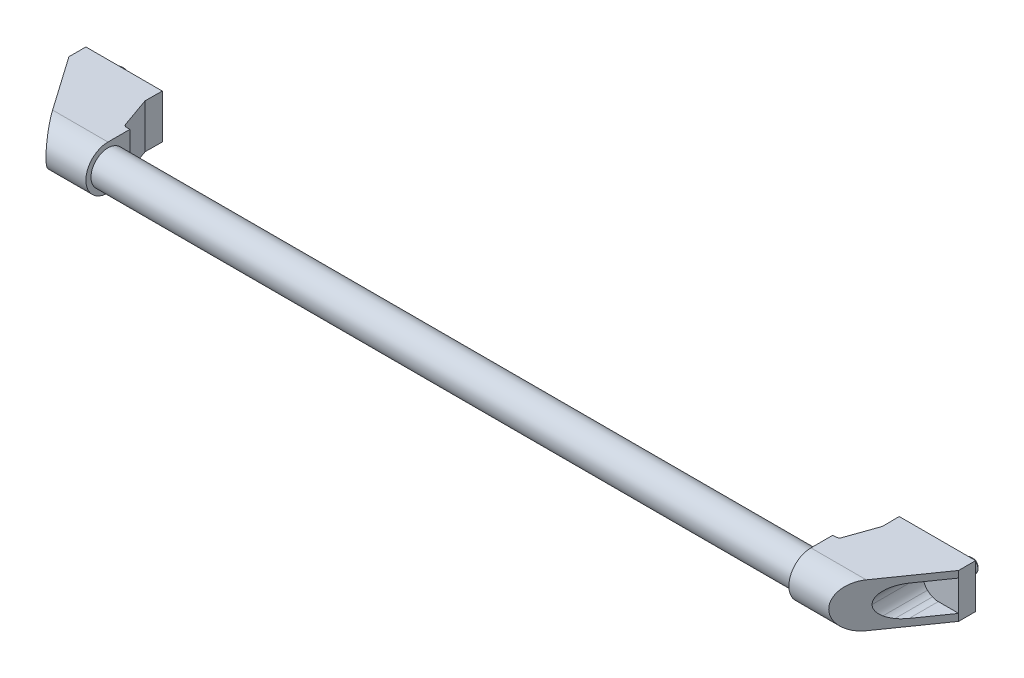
ISO-10303-21;
HEADER;
FILE_DESCRIPTION(('STEP AP214'),'2;1');
FILE_NAME('part.step','',(''),(''),'','','');
FILE_SCHEMA(('AUTOMOTIVE_DESIGN { 1 0 10303 214 1 1 1 1 }'));
ENDSEC;
DATA;
#1=APPLICATION_CONTEXT('core data for automotive mechanical design processes');
#2=APPLICATION_PROTOCOL_DEFINITION('international standard','automotive_design',2000,#1);
#3=PRODUCT_CONTEXT('',#1,'mechanical');
#4=PRODUCT('Part','Part','',(#3));
#5=PRODUCT_RELATED_PRODUCT_CATEGORY('part','',(#4));
#6=PRODUCT_DEFINITION_FORMATION('','',#4);
#7=PRODUCT_DEFINITION_CONTEXT('part definition',#1,'design');
#8=PRODUCT_DEFINITION('design','',#6,#7);
#9=PRODUCT_DEFINITION_SHAPE('','',#8);
#10=(LENGTH_UNIT() NAMED_UNIT(*) SI_UNIT(.MILLI.,.METRE.));
#11=(NAMED_UNIT(*) PLANE_ANGLE_UNIT() SI_UNIT($,.RADIAN.));
#12=(NAMED_UNIT(*) SI_UNIT($,.STERADIAN.) SOLID_ANGLE_UNIT());
#13=UNCERTAINTY_MEASURE_WITH_UNIT(LENGTH_MEASURE(1.E-05),#10,'distance_accuracy_value','');
#14=(GEOMETRIC_REPRESENTATION_CONTEXT(3) GLOBAL_UNCERTAINTY_ASSIGNED_CONTEXT((#13)) GLOBAL_UNIT_ASSIGNED_CONTEXT((#10,
#11,#12)) REPRESENTATION_CONTEXT('',''));
#15=CARTESIAN_POINT('',(0.,0.,0.));
#16=DIRECTION('',(0.,0.,1.));
#17=DIRECTION('',(1.,0.,0.));
#18=AXIS2_PLACEMENT_3D('',#15,#16,#17);
#19=CARTESIAN_POINT('',(-12.,13.,0.));
#20=DIRECTION('',(0.,0.,-1.));
#21=DIRECTION('',(1.,0.,0.));
#22=AXIS2_PLACEMENT_3D('',#19,#20,#21);
#23=PLANE('',#22);
#24=DIRECTION('',(0.,-1.,0.));
#25=VECTOR('',#24,1.);
#26=CARTESIAN_POINT('',(13.,8.,0.));
#27=LINE('',#26,#25);
#28=CARTESIAN_POINT('',(13.,8.,0.));
#29=VERTEX_POINT('',#28);
#30=CARTESIAN_POINT('',(13.,-8.,0.));
#31=VERTEX_POINT('',#30);
#32=EDGE_CURVE('E317',#29,#31,#27,.T.);
#33=ORIENTED_EDGE('',*,*,#32,.T.);
#34=DIRECTION('',(-1.,0.,0.));
#35=VECTOR('',#34,1.);
#36=CARTESIAN_POINT('',(28.,-8.,0.));
#37=LINE('',#36,#35);
#38=CARTESIAN_POINT('',(28.,-8.,0.));
#39=VERTEX_POINT('',#38);
#40=EDGE_CURVE('E304',#39,#31,#37,.T.);
#41=ORIENTED_EDGE('',*,*,#40,.F.);
#42=DIRECTION('',(0.,1.,0.));
#43=VECTOR('',#42,1.);
#44=CARTESIAN_POINT('',(28.,-8.,0.));
#45=LINE('',#44,#43);
#46=CARTESIAN_POINT('',(28.,8.,0.));
#47=VERTEX_POINT('',#46);
#48=EDGE_CURVE('E287',#39,#47,#45,.T.);
#49=ORIENTED_EDGE('',*,*,#48,.T.);
#50=DIRECTION('',(1.,0.,0.));
#51=VECTOR('',#50,1.);
#52=CARTESIAN_POINT('',(13.,8.,0.));
#53=LINE('',#52,#51);
#54=EDGE_CURVE('E301',#29,#47,#53,.T.);
#55=ORIENTED_EDGE('',*,*,#54,.F.);
#56=EDGE_LOOP('',(#33,#41,#49,#55));
#57=FACE_BOUND('',#56,.T.);
#58=DIRECTION('',(0.,1.,0.));
#59=VECTOR('',#58,1.);
#60=CARTESIAN_POINT('',(33.,-13.,0.));
#61=LINE('',#60,#59);
#62=CARTESIAN_POINT('',(33.,-13.,0.));
#63=VERTEX_POINT('',#62);
#64=CARTESIAN_POINT('',(33.,13.,0.));
#65=VERTEX_POINT('',#64);
#66=EDGE_CURVE('E410',#63,#65,#61,.T.);
#67=ORIENTED_EDGE('',*,*,#66,.F.);
#68=DIRECTION('',(1.,0.,0.));
#69=VECTOR('',#68,1.);
#70=CARTESIAN_POINT('',(-12.,-13.,0.));
#71=LINE('',#70,#69);
#72=CARTESIAN_POINT('',(-12.,-13.,0.));
#73=VERTEX_POINT('',#72);
#74=EDGE_CURVE('E444',#73,#63,#71,.T.);
#75=ORIENTED_EDGE('',*,*,#74,.F.);
#76=DIRECTION('',(0.,-1.,0.));
#77=VECTOR('',#76,1.);
#78=CARTESIAN_POINT('',(-12.,13.,0.));
#79=LINE('',#78,#77);
#80=CARTESIAN_POINT('',(-12.,13.,0.));
#81=VERTEX_POINT('',#80);
#82=EDGE_CURVE('E436',#81,#73,#79,.T.);
#83=ORIENTED_EDGE('',*,*,#82,.F.);
#84=DIRECTION('',(1.,0.,0.));
#85=VECTOR('',#84,1.);
#86=CARTESIAN_POINT('',(-12.,13.,0.));
#87=LINE('',#86,#85);
#88=EDGE_CURVE('E441',#81,#65,#87,.T.);
#89=ORIENTED_EDGE('',*,*,#88,.T.);
#90=EDGE_LOOP('',(#67,#75,#83,#89));
#91=FACE_BOUND('',#90,.T.);
#92=CARTESIAN_POINT('',(0.,0.,0.));
#93=DIRECTION('',(0.,0.,-1.));
#94=DIRECTION('',(-1.,0.,0.));
#95=AXIS2_PLACEMENT_3D('',#92,#93,#94);
#96=CIRCLE('',#95,4.);
#97=CARTESIAN_POINT('',(-4.,0.,0.));
#98=VERTEX_POINT('',#97);
#99=EDGE_CURVE('E1268',#98,#98,#96,.T.);
#100=ORIENTED_EDGE('',*,*,#99,.F.);
#101=EDGE_LOOP('',(#100));
#102=FACE_BOUND('',#101,.T.);
#103=ADVANCED_FACE('F14',(#57,#91,#102),#23,.T.);
#104=CARTESIAN_POINT('',(-12.,-13.,10.));
#105=DIRECTION('',(0.819152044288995,0.,-0.573576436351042));
#106=DIRECTION('',(0.573576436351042,0.,0.819152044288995));
#107=AXIS2_PLACEMENT_3D('',#104,#105,#106);
#108=PLANE('',#107);
#109=DIRECTION('',(-0.573576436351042,0.,-0.819152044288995));
#110=VECTOR('',#109,1.);
#111=CARTESIAN_POINT('',(-12.,-8.90119415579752,10.));
#112=LINE('',#111,#110);
#113=CARTESIAN_POINT('',(7.15225701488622E-06,-8.90119415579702,27.1377862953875));
#114=VERTEX_POINT('',#113);
#115=CARTESIAN_POINT('',(-12.,-8.90119415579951,10.));
#116=VERTEX_POINT('',#115);
#117=EDGE_CURVE('E472',#114,#116,#112,.T.);
#118=ORIENTED_EDGE('',*,*,#117,.T.);
#119=DIRECTION('',(0.,1.,0.));
#120=VECTOR('',#119,1.);
#121=CARTESIAN_POINT('',(-12.,-13.,10.));
#122=LINE('',#121,#120);
#123=CARTESIAN_POINT('',(-12.,-13.,10.));
#124=VERTEX_POINT('',#123);
#125=EDGE_CURVE('E420',#124,#116,#122,.T.);
#126=ORIENTED_EDGE('',*,*,#125,.F.);
#127=DIRECTION('',(0.573576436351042,0.,0.819152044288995));
#128=VECTOR('',#127,1.);
#129=CARTESIAN_POINT('',(-12.,-13.,10.));
#130=LINE('',#129,#128);
#131=CARTESIAN_POINT('',(10.4066412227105,-13.,42.));
#132=VERTEX_POINT('',#131);
#133=EDGE_CURVE('E416',#124,#132,#130,.T.);
#134=ORIENTED_EDGE('',*,*,#133,.T.);
#135=CARTESIAN_POINT('',(10.4066412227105,0.,42.));
#136=DIRECTION('',(-0.819152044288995,0.,0.573576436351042));
#137=DIRECTION('',(0.573576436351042,0.,0.819152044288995));
#138=AXIS2_PLACEMENT_3D('',#135,#136,#137);
#139=ELLIPSE('',#138,15.8700696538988,13.);
#140=CARTESIAN_POINT('',(10.4066412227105,13.,42.));
#141=VERTEX_POINT('',#140);
#142=EDGE_CURVE('E423',#132,#141,#139,.T.);
#143=ORIENTED_EDGE('',*,*,#142,.T.);
#144=DIRECTION('',(0.573576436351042,0.,0.819152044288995));
#145=VECTOR('',#144,1.);
#146=CARTESIAN_POINT('',(-12.,13.,10.));
#147=LINE('',#146,#145);
#148=CARTESIAN_POINT('',(-12.,13.,10.));
#149=VERTEX_POINT('',#148);
#150=EDGE_CURVE('E413',#149,#141,#147,.T.);
#151=ORIENTED_EDGE('',*,*,#150,.F.);
#152=CARTESIAN_POINT('',(-12.,9.09880893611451,10.));
#153=VERTEX_POINT('',#152);
#154=EDGE_CURVE('E419',#153,#149,#122,.T.);
#155=ORIENTED_EDGE('',*,*,#154,.F.);
#156=DIRECTION('',(-0.573576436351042,0.,-0.819152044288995));
#157=VECTOR('',#156,1.);
#158=CARTESIAN_POINT('',(-12.,9.09880893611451,10.));
#159=LINE('',#158,#157);
#160=CARTESIAN_POINT('',(0.,9.09880893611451,27.1377760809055));
#161=VERTEX_POINT('',#160);
#162=EDGE_CURVE('E451',#161,#153,#159,.T.);
#163=ORIENTED_EDGE('',*,*,#162,.F.);
#164=CARTESIAN_POINT('',(-6.61501399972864E-06,0.098772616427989,27.1377666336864));
#165=DIRECTION('',(-0.819152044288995,0.,0.573576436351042));
#166=DIRECTION('',(0.573576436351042,0.,0.819152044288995));
#167=AXIS2_PLACEMENT_3D('',#164,#165,#166);
#168=ELLIPSE('',#167,15.691084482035,9.0000363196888);
#169=CARTESIAN_POINT('',(3.444151,8.4137249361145,32.056533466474));
#170=VERTEX_POINT('',#169);
#171=EDGE_CURVE('E454',#170,#161,#168,.T.);
#172=ORIENTED_EDGE('',*,*,#171,.F.);
#173=CARTESIAN_POINT('',(-2.10368269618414E-05,0.0987787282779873,27.137746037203));
#174=DIRECTION('',(-0.819152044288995,0.,0.573576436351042));
#175=DIRECTION('',(0.573576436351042,0.,0.819152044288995));
#176=AXIS2_PLACEMENT_3D('',#173,#174,#175);
#177=ELLIPSE('',#176,15.6910842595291,9.00003619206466);
#178=CARTESIAN_POINT('',(6.363961,6.4627699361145,36.22645429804));
#179=VERTEX_POINT('',#178);
#180=EDGE_CURVE('E457',#179,#170,#177,.T.);
#181=ORIENTED_EDGE('',*,*,#180,.F.);
#182=CARTESIAN_POINT('',(-3.07078370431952E-05,0.098790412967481,27.13773222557));
#183=DIRECTION('',(-0.819152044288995,0.,0.573576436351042));
#184=DIRECTION('',(0.573576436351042,0.,0.819152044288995));
#185=AXIS2_PLACEMENT_3D('',#182,#183,#184);
#186=ELLIPSE('',#185,15.6910817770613,9.00003476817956);
#187=CARTESIAN_POINT('',(9.00000406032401,0.0988089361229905,39.9911139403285));
#188=VERTEX_POINT('',#187);
#189=EDGE_CURVE('E460',#188,#179,#186,.T.);
#190=ORIENTED_EDGE('',*,*,#189,.F.);
#191=CARTESIAN_POINT('',(-3.27593630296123E-05,0.0988180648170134,27.1377292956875));
#192=DIRECTION('',(-0.819152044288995,0.,0.573576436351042));
#193=DIRECTION('',(0.573576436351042,0.,0.819152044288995));
#194=AXIS2_PLACEMENT_3D('',#191,#192,#193);
#195=ELLIPSE('',#194,15.6910853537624,9.00003681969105);
#196=CARTESIAN_POINT('',(6.36396815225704,-6.26515515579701,36.2264645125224));
#197=VERTEX_POINT('',#196);
#198=EDGE_CURVE('E463',#197,#188,#195,.T.);
#199=ORIENTED_EDGE('',*,*,#198,.F.);
#200=CARTESIAN_POINT('',(-1.3884569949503E-05,0.0988360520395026,27.137756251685));
#201=DIRECTION('',(-0.819152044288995,0.,0.573576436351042));
#202=DIRECTION('',(0.573576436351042,0.,0.819152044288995));
#203=AXIS2_PLACEMENT_3D('',#200,#201,#202);
#204=ELLIPSE('',#203,15.6910842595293,9.00003619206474);
#205=CARTESIAN_POINT('',(3.44415815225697,-8.21611015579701,32.0565436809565));
#206=VERTEX_POINT('',#205);
#207=EDGE_CURVE('E466',#206,#197,#204,.T.);
#208=ORIENTED_EDGE('',*,*,#207,.F.);
#209=CARTESIAN_POINT('',(5.37243011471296E-07,0.0988421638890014,27.1377768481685));
#210=DIRECTION('',(-0.819152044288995,0.,0.573576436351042));
#211=DIRECTION('',(0.573576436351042,0.,0.819152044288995));
#212=AXIS2_PLACEMENT_3D('',#209,#210,#211);
#213=ELLIPSE('',#212,15.6910844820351,9.00003631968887);
#214=EDGE_CURVE('E469',#114,#206,#213,.T.);
#215=ORIENTED_EDGE('',*,*,#214,.F.);
#216=EDGE_LOOP('',(#118,#126,#134,#143,#151,#155,#163,#172,#181,#190,#199,#208,#215));
#217=FACE_BOUND('',#216,.T.);
#218=ADVANCED_FACE('F725',(#217),#108,.F.);
#219=CARTESIAN_POINT('',(-12.,13.,42.));
#220=DIRECTION('',(0.,1.,0.));
#221=DIRECTION('',(1.,0.,0.));
#222=AXIS2_PLACEMENT_3D('',#219,#220,#221);
#223=PLANE('',#222);
#224=DIRECTION('',(0.0104830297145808,0.,-0.999945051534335));
#225=VECTOR('',#224,1.);
#226=CARTESIAN_POINT('',(32.895169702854,13.,9.99945051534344));
#227=LINE('',#226,#225);
#228=CARTESIAN_POINT('',(32.895169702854,13.,9.99945051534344));
#229=VERTEX_POINT('',#228);
#230=EDGE_CURVE('E388',#229,#65,#227,.T.);
#231=ORIENTED_EDGE('',*,*,#230,.T.);
#232=ORIENTED_EDGE('',*,*,#88,.F.);
#233=DIRECTION('',(0.,0.,-1.));
#234=VECTOR('',#233,1.);
#235=CARTESIAN_POINT('',(-12.,13.,42.));
#236=LINE('',#235,#234);
#237=EDGE_CURVE('E434',#149,#81,#236,.T.);
#238=ORIENTED_EDGE('',*,*,#237,.F.);
#239=ORIENTED_EDGE('',*,*,#150,.T.);
#240=DIRECTION('',(1.,0.,0.));
#241=VECTOR('',#240,1.);
#242=CARTESIAN_POINT('',(-12.,13.,42.));
#243=LINE('',#242,#241);
#244=CARTESIAN_POINT('',(43.,13.,42.));
#245=VERTEX_POINT('',#244);
#246=EDGE_CURVE('E449',#141,#245,#243,.T.);
#247=ORIENTED_EDGE('',*,*,#246,.T.);
#248=DIRECTION('',(0.,0.,-1.));
#249=VECTOR('',#248,1.);
#250=CARTESIAN_POINT('',(43.,13.,42.));
#251=LINE('',#250,#249);
#252=CARTESIAN_POINT('',(43.,13.,29.106429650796));
#253=VERTEX_POINT('',#252);
#254=EDGE_CURVE('E425',#245,#253,#251,.T.);
#255=ORIENTED_EDGE('',*,*,#254,.T.);
#256=DIRECTION('',(-0.999945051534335,0.,-0.0104830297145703));
#257=VECTOR('',#256,1.);
#258=CARTESIAN_POINT('',(43.,13.,29.106429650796));
#259=LINE('',#258,#257);
#260=CARTESIAN_POINT('',(41.0113841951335,13.,29.0855817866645));
#261=VERTEX_POINT('',#260);
#262=EDGE_CURVE('E379',#253,#261,#259,.T.);
#263=ORIENTED_EDGE('',*,*,#262,.T.);
#264=CARTESIAN_POINT('',(41.032350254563,13.,27.085691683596));
#265=DIRECTION('',(0.,-1.,0.));
#266=DIRECTION('',(1.,0.,0.));
#267=AXIS2_PLACEMENT_3D('',#264,#265,#266);
#268=CIRCLE('',#267,2.);
#269=CARTESIAN_POINT('',(39.1458974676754,13.,27.7499927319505));
#270=VERTEX_POINT('',#269);
#271=EDGE_CURVE('E382',#261,#270,#268,.T.);
#272=ORIENTED_EDGE('',*,*,#271,.T.);
#273=DIRECTION('',(0.332150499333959,0.,0.943226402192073));
#274=VECTOR('',#273,1.);
#275=CARTESIAN_POINT('',(32.895169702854,13.,9.99945051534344));
#276=LINE('',#275,#274);
#277=EDGE_CURVE('E385',#229,#270,#276,.T.);
#278=ORIENTED_EDGE('',*,*,#277,.F.);
#279=EDGE_LOOP('',(#231,#232,#238,#239,#247,#255,#263,#272,#278));
#280=FACE_BOUND('',#279,.T.);
#281=ADVANCED_FACE('F731',(#280),#223,.T.);
#282=CARTESIAN_POINT('',(-12.,0.,42.));
#283=DIRECTION('',(1.,0.,0.));
#284=DIRECTION('',(0.,-1.,0.));
#285=AXIS2_PLACEMENT_3D('',#282,#283,#284);
#286=CYLINDRICAL_SURFACE('',#285,13.);
#287=ORIENTED_EDGE('',*,*,#142,.F.);
#288=DIRECTION('',(1.,0.,0.));
#289=VECTOR('',#288,1.);
#290=CARTESIAN_POINT('',(-12.,-13.,42.));
#291=LINE('',#290,#289);
#292=CARTESIAN_POINT('',(43.,-13.,42.));
#293=VERTEX_POINT('',#292);
#294=EDGE_CURVE('E447',#132,#293,#291,.T.);
#295=ORIENTED_EDGE('',*,*,#294,.T.);
#296=CARTESIAN_POINT('',(43.,0.,42.));
#297=DIRECTION('',(1.,0.,0.));
#298=DIRECTION('',(0.,1.,0.));
#299=AXIS2_PLACEMENT_3D('',#296,#297,#298);
#300=CIRCLE('',#299,13.);
#301=EDGE_CURVE('E431',#245,#293,#300,.T.);
#302=ORIENTED_EDGE('',*,*,#301,.F.);
#303=ORIENTED_EDGE('',*,*,#246,.F.);
#304=EDGE_LOOP('',(#287,#295,#302,#303));
#305=FACE_BOUND('',#304,.T.);
#306=ADVANCED_FACE('F741',(#305),#286,.T.);
#307=CARTESIAN_POINT('',(-12.,-13.,42.));
#308=DIRECTION('',(0.,1.,0.));
#309=DIRECTION('',(1.,0.,0.));
#310=AXIS2_PLACEMENT_3D('',#307,#308,#309);
#311=PLANE('',#310);
#312=DIRECTION('',(0.332150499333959,0.,0.943226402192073));
#313=VECTOR('',#312,1.);
#314=CARTESIAN_POINT('',(32.895169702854,-13.,9.99945051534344));
#315=LINE('',#314,#313);
#316=CARTESIAN_POINT('',(32.895169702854,-13.,9.99945051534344));
#317=VERTEX_POINT('',#316);
#318=CARTESIAN_POINT('',(39.1458974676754,-13.,27.7499927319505));
#319=VERTEX_POINT('',#318);
#320=EDGE_CURVE('E396',#317,#319,#315,.T.);
#321=ORIENTED_EDGE('',*,*,#320,.T.);
#322=CARTESIAN_POINT('',(41.032350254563,-13.,27.085691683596));
#323=DIRECTION('',(0.,-1.,0.));
#324=DIRECTION('',(1.,0.,0.));
#325=AXIS2_PLACEMENT_3D('',#322,#323,#324);
#326=CIRCLE('',#325,2.);
#327=CARTESIAN_POINT('',(41.0113841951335,-13.,29.0855817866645));
#328=VERTEX_POINT('',#327);
#329=EDGE_CURVE('E393',#328,#319,#326,.T.);
#330=ORIENTED_EDGE('',*,*,#329,.F.);
#331=DIRECTION('',(-0.999945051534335,0.,-0.0104830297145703));
#332=VECTOR('',#331,1.);
#333=CARTESIAN_POINT('',(43.,-13.,29.106429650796));
#334=LINE('',#333,#332);
#335=CARTESIAN_POINT('',(43.,-13.,29.106429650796));
#336=VERTEX_POINT('',#335);
#337=EDGE_CURVE('E390',#336,#328,#334,.T.);
#338=ORIENTED_EDGE('',*,*,#337,.F.);
#339=DIRECTION('',(0.,0.,-1.));
#340=VECTOR('',#339,1.);
#341=CARTESIAN_POINT('',(43.,-13.,42.));
#342=LINE('',#341,#340);
#343=EDGE_CURVE('E428',#293,#336,#342,.T.);
#344=ORIENTED_EDGE('',*,*,#343,.F.);
#345=ORIENTED_EDGE('',*,*,#294,.F.);
#346=ORIENTED_EDGE('',*,*,#133,.F.);
#347=DIRECTION('',(0.,0.,-1.));
#348=VECTOR('',#347,1.);
#349=CARTESIAN_POINT('',(-12.,-13.,42.));
#350=LINE('',#349,#348);
#351=EDGE_CURVE('E439',#124,#73,#350,.T.);
#352=ORIENTED_EDGE('',*,*,#351,.T.);
#353=ORIENTED_EDGE('',*,*,#74,.T.);
#354=DIRECTION('',(0.0104830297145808,0.,-0.999945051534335));
#355=VECTOR('',#354,1.);
#356=CARTESIAN_POINT('',(32.895169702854,-13.,9.99945051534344));
#357=LINE('',#356,#355);
#358=EDGE_CURVE('E399',#317,#63,#357,.T.);
#359=ORIENTED_EDGE('',*,*,#358,.F.);
#360=EDGE_LOOP('',(#321,#330,#338,#344,#345,#346,#352,#353,#359));
#361=FACE_BOUND('',#360,.T.);
#362=ADVANCED_FACE('F737',(#361),#311,.F.);
#363=CARTESIAN_POINT('',(-12.,0.,42.));
#364=DIRECTION('',(-1.,0.,0.));
#365=DIRECTION('',(0.,1.,0.));
#366=AXIS2_PLACEMENT_3D('',#363,#364,#365);
#367=PLANE('',#366);
#368=ORIENTED_EDGE('',*,*,#125,.T.);
#369=DIRECTION('',(0.,1.,0.));
#370=VECTOR('',#369,1.);
#371=CARTESIAN_POINT('',(-12.,-8.90119415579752,10.));
#372=LINE('',#371,#370);
#373=EDGE_CURVE('E355',#116,#153,#372,.T.);
#374=ORIENTED_EDGE('',*,*,#373,.T.);
#375=ORIENTED_EDGE('',*,*,#154,.T.);
#376=ORIENTED_EDGE('',*,*,#237,.T.);
#377=ORIENTED_EDGE('',*,*,#82,.T.);
#378=ORIENTED_EDGE('',*,*,#351,.F.);
#379=EDGE_LOOP('',(#368,#374,#375,#376,#377,#378));
#380=FACE_BOUND('',#379,.T.);
#381=ADVANCED_FACE('F740',(#380),#367,.T.);
#382=CARTESIAN_POINT('',(43.,0.,42.));
#383=DIRECTION('',(-1.,0.,0.));
#384=DIRECTION('',(0.,1.,0.));
#385=AXIS2_PLACEMENT_3D('',#382,#383,#384);
#386=PLANE('',#385);
#387=ORIENTED_EDGE('',*,*,#254,.F.);
#388=ORIENTED_EDGE('',*,*,#301,.T.);
#389=ORIENTED_EDGE('',*,*,#343,.T.);
#390=DIRECTION('',(0.,1.,0.));
#391=VECTOR('',#390,1.);
#392=CARTESIAN_POINT('',(43.,-13.,29.106429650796));
#393=LINE('',#392,#391);
#394=EDGE_CURVE('E402',#336,#253,#393,.T.);
#395=ORIENTED_EDGE('',*,*,#394,.T.);
#396=EDGE_LOOP('',(#387,#388,#389,#395));
#397=FACE_BOUND('',#396,.T.);
#398=CARTESIAN_POINT('',(43.,0.,42.));
#399=DIRECTION('',(-1.,0.,0.));
#400=DIRECTION('',(0.,0.,1.));
#401=AXIS2_PLACEMENT_3D('',#398,#399,#400);
#402=CIRCLE('',#401,10.);
#403=CARTESIAN_POINT('',(43.,0.,52.));
#404=VERTEX_POINT('',#403);
#405=EDGE_CURVE('E1264',#404,#404,#402,.T.);
#406=ORIENTED_EDGE('',*,*,#405,.T.);
#407=EDGE_LOOP('',(#406));
#408=FACE_BOUND('',#407,.T.);
#409=ADVANCED_FACE('F1207',(#397,#408),#386,.F.);
#410=CARTESIAN_POINT('',(32.895169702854,-13.,9.99945051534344));
#411=DIRECTION('',(-0.999945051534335,0.,-0.0104830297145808));
#412=DIRECTION('',(0.0104830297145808,0.,-0.999945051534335));
#413=AXIS2_PLACEMENT_3D('',#410,#411,#412);
#414=PLANE('',#413);
#415=DIRECTION('',(0.,1.,0.));
#416=VECTOR('',#415,1.);
#417=CARTESIAN_POINT('',(32.895169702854,-13.,9.99945051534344));
#418=LINE('',#417,#416);
#419=EDGE_CURVE('E408',#317,#229,#418,.T.);
#420=ORIENTED_EDGE('',*,*,#419,.F.);
#421=ORIENTED_EDGE('',*,*,#358,.T.);
#422=ORIENTED_EDGE('',*,*,#66,.T.);
#423=ORIENTED_EDGE('',*,*,#230,.F.);
#424=EDGE_LOOP('',(#420,#421,#422,#423));
#425=FACE_BOUND('',#424,.T.);
#426=ADVANCED_FACE('F1198',(#425),#414,.F.);
#427=CARTESIAN_POINT('',(32.895169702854,-13.,9.99945051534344));
#428=DIRECTION('',(0.943226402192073,0.,-0.332150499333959));
#429=DIRECTION('',(0.332150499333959,0.,0.943226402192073));
#430=AXIS2_PLACEMENT_3D('',#427,#428,#429);
#431=PLANE('',#430);
#432=DIRECTION('',(0.,1.,0.));
#433=VECTOR('',#432,1.);
#434=CARTESIAN_POINT('',(39.1458974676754,-13.,27.7499927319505));
#435=LINE('',#434,#433);
#436=EDGE_CURVE('E406',#319,#270,#435,.T.);
#437=ORIENTED_EDGE('',*,*,#436,.F.);
#438=ORIENTED_EDGE('',*,*,#320,.F.);
#439=ORIENTED_EDGE('',*,*,#419,.T.);
#440=ORIENTED_EDGE('',*,*,#277,.T.);
#441=EDGE_LOOP('',(#437,#438,#439,#440));
#442=FACE_BOUND('',#441,.T.);
#443=ADVANCED_FACE('F1189',(#442),#431,.T.);
#444=CARTESIAN_POINT('',(41.032350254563,-13.,27.085691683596));
#445=DIRECTION('',(0.,1.,0.));
#446=DIRECTION('',(1.,0.,0.));
#447=AXIS2_PLACEMENT_3D('',#444,#445,#446);
#448=CYLINDRICAL_SURFACE('',#447,2.);
#449=DIRECTION('',(0.,1.,0.));
#450=VECTOR('',#449,1.);
#451=CARTESIAN_POINT('',(41.0113841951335,-13.,29.0855817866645));
#452=LINE('',#451,#450);
#453=EDGE_CURVE('E404',#328,#261,#452,.T.);
#454=ORIENTED_EDGE('',*,*,#453,.F.);
#455=ORIENTED_EDGE('',*,*,#329,.T.);
#456=ORIENTED_EDGE('',*,*,#436,.T.);
#457=ORIENTED_EDGE('',*,*,#271,.F.);
#458=EDGE_LOOP('',(#454,#455,#456,#457));
#459=FACE_BOUND('',#458,.T.);
#460=ADVANCED_FACE('F1180',(#459),#448,.F.);
#461=CARTESIAN_POINT('',(43.,-13.,29.106429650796));
#462=DIRECTION('',(-0.0104830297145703,0.,0.999945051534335));
#463=DIRECTION('',(-0.999945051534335,0.,-0.0104830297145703));
#464=AXIS2_PLACEMENT_3D('',#461,#462,#463);
#465=PLANE('',#464);
#466=ORIENTED_EDGE('',*,*,#394,.F.);
#467=ORIENTED_EDGE('',*,*,#337,.T.);
#468=ORIENTED_EDGE('',*,*,#453,.T.);
#469=ORIENTED_EDGE('',*,*,#262,.F.);
#470=EDGE_LOOP('',(#466,#467,#468,#469));
#471=FACE_BOUND('',#470,.T.);
#472=ADVANCED_FACE('F1171',(#471),#465,.F.);
#473=CARTESIAN_POINT('',(-12.,-8.90119415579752,10.));
#474=DIRECTION('',(0.,1.,0.));
#475=DIRECTION('',(1.,0.,0.));
#476=AXIS2_PLACEMENT_3D('',#473,#474,#475);
#477=PLANE('',#476);
#478=ORIENTED_EDGE('',*,*,#117,.F.);
#479=DIRECTION('',(0.,0.,1.));
#480=VECTOR('',#479,1.);
#481=CARTESIAN_POINT('',(7.15225700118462E-06,-8.90119415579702,10.));
#482=LINE('',#481,#480);
#483=CARTESIAN_POINT('',(7.15225700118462E-06,-8.90119415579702,10.));
#484=VERTEX_POINT('',#483);
#485=EDGE_CURVE('E376',#484,#114,#482,.T.);
#486=ORIENTED_EDGE('',*,*,#485,.F.);
#487=DIRECTION('',(1.,0.,0.));
#488=VECTOR('',#487,1.);
#489=CARTESIAN_POINT('',(-12.,-8.90119415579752,10.));
#490=LINE('',#489,#488);
#491=EDGE_CURVE('E294',#116,#484,#490,.T.);
#492=ORIENTED_EDGE('',*,*,#491,.F.);
#493=EDGE_LOOP('',(#478,#486,#492));
#494=FACE_BOUND('',#493,.T.);
#495=ADVANCED_FACE('F1162',(#494),#477,.T.);
#496=CARTESIAN_POINT('',(5.37243022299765E-07,0.0988421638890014,10.));
#497=DIRECTION('',(0.,0.,1.));
#498=DIRECTION('',(-1.,0.,0.));
#499=AXIS2_PLACEMENT_3D('',#496,#497,#498);
#500=CYLINDRICAL_SURFACE('',#499,9.00003631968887);
#501=ORIENTED_EDGE('',*,*,#485,.T.);
#502=ORIENTED_EDGE('',*,*,#214,.T.);
#503=DIRECTION('',(0.,0.,1.));
#504=VECTOR('',#503,1.);
#505=CARTESIAN_POINT('',(3.44415815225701,-8.21611015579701,10.));
#506=LINE('',#505,#504);
#507=CARTESIAN_POINT('',(3.44415815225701,-8.21611015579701,10.));
#508=VERTEX_POINT('',#507);
#509=EDGE_CURVE('E373',#508,#206,#506,.T.);
#510=ORIENTED_EDGE('',*,*,#509,.F.);
#511=CARTESIAN_POINT('',(5.37243022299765E-07,0.0988421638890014,10.));
#512=DIRECTION('',(0.,0.,-1.));
#513=DIRECTION('',(-1.,0.,0.));
#514=AXIS2_PLACEMENT_3D('',#511,#512,#513);
#515=CIRCLE('',#514,9.00003631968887);
#516=EDGE_CURVE('E334',#508,#484,#515,.T.);
#517=ORIENTED_EDGE('',*,*,#516,.T.);
#518=EDGE_LOOP('',(#501,#502,#510,#517));
#519=FACE_BOUND('',#518,.T.);
#520=ADVANCED_FACE('F1153',(#519),#500,.F.);
#521=CARTESIAN_POINT('',(-1.38845699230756E-05,0.0988360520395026,10.));
#522=DIRECTION('',(0.,0.,1.));
#523=DIRECTION('',(-1.,0.,0.));
#524=AXIS2_PLACEMENT_3D('',#521,#522,#523);
#525=CYLINDRICAL_SURFACE('',#524,9.00003619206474);
#526=ORIENTED_EDGE('',*,*,#509,.T.);
#527=ORIENTED_EDGE('',*,*,#207,.T.);
#528=DIRECTION('',(0.,0.,1.));
#529=VECTOR('',#528,1.);
#530=CARTESIAN_POINT('',(6.36396815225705,-6.26515515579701,10.));
#531=LINE('',#530,#529);
#532=CARTESIAN_POINT('',(6.36396815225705,-6.26515515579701,10.));
#533=VERTEX_POINT('',#532);
#534=EDGE_CURVE('E370',#533,#197,#531,.T.);
#535=ORIENTED_EDGE('',*,*,#534,.F.);
#536=CARTESIAN_POINT('',(-1.38845699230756E-05,0.0988360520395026,10.));
#537=DIRECTION('',(0.,0.,-1.));
#538=DIRECTION('',(-1.,0.,0.));
#539=AXIS2_PLACEMENT_3D('',#536,#537,#538);
#540=CIRCLE('',#539,9.00003619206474);
#541=EDGE_CURVE('E337',#533,#508,#540,.T.);
#542=ORIENTED_EDGE('',*,*,#541,.T.);
#543=EDGE_LOOP('',(#526,#527,#535,#542));
#544=FACE_BOUND('',#543,.T.);
#545=ADVANCED_FACE('F1144',(#544),#525,.F.);
#546=CARTESIAN_POINT('',(-3.27593630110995E-05,0.0988180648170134,10.));
#547=DIRECTION('',(0.,0.,1.));
#548=DIRECTION('',(-1.,0.,0.));
#549=AXIS2_PLACEMENT_3D('',#546,#547,#548);
#550=CYLINDRICAL_SURFACE('',#549,9.00003681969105);
#551=ORIENTED_EDGE('',*,*,#534,.T.);
#552=ORIENTED_EDGE('',*,*,#198,.T.);
#553=DIRECTION('',(0.,0.,1.));
#554=VECTOR('',#553,1.);
#555=CARTESIAN_POINT('',(9.00000406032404,0.0988089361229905,10.));
#556=LINE('',#555,#554);
#557=CARTESIAN_POINT('',(9.00000406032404,0.0988089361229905,10.));
#558=VERTEX_POINT('',#557);
#559=EDGE_CURVE('E367',#558,#188,#556,.T.);
#560=ORIENTED_EDGE('',*,*,#559,.F.);
#561=CARTESIAN_POINT('',(-3.27593630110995E-05,0.0988180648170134,10.));
#562=DIRECTION('',(0.,0.,-1.));
#563=DIRECTION('',(-1.,0.,0.));
#564=AXIS2_PLACEMENT_3D('',#561,#562,#563);
#565=CIRCLE('',#564,9.00003681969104);
#566=EDGE_CURVE('E340',#558,#533,#565,.T.);
#567=ORIENTED_EDGE('',*,*,#566,.T.);
#568=EDGE_LOOP('',(#551,#552,#560,#567));
#569=FACE_BOUND('',#568,.T.);
#570=ADVANCED_FACE('F1135',(#569),#550,.F.);
#571=CARTESIAN_POINT('',(-3.07078370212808E-05,0.098790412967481,10.));
#572=DIRECTION('',(0.,0.,1.));
#573=DIRECTION('',(-1.,0.,0.));
#574=AXIS2_PLACEMENT_3D('',#571,#572,#573);
#575=CYLINDRICAL_SURFACE('',#574,9.00003476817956);
#576=ORIENTED_EDGE('',*,*,#559,.T.);
#577=ORIENTED_EDGE('',*,*,#189,.T.);
#578=DIRECTION('',(0.,0.,1.));
#579=VECTOR('',#578,1.);
#580=CARTESIAN_POINT('',(6.363961,6.4627699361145,10.));
#581=LINE('',#580,#579);
#582=CARTESIAN_POINT('',(6.363961,6.4627699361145,10.));
#583=VERTEX_POINT('',#582);
#584=EDGE_CURVE('E364',#583,#179,#581,.T.);
#585=ORIENTED_EDGE('',*,*,#584,.F.);
#586=CARTESIAN_POINT('',(-3.07078370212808E-05,0.098790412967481,10.));
#587=DIRECTION('',(0.,0.,-1.));
#588=DIRECTION('',(-1.,0.,0.));
#589=AXIS2_PLACEMENT_3D('',#586,#587,#588);
#590=CIRCLE('',#589,9.00003476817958);
#591=EDGE_CURVE('E343',#583,#558,#590,.T.);
#592=ORIENTED_EDGE('',*,*,#591,.T.);
#593=EDGE_LOOP('',(#576,#577,#585,#592));
#594=FACE_BOUND('',#593,.T.);
#595=ADVANCED_FACE('F1126',(#594),#575,.F.);
#596=CARTESIAN_POINT('',(-2.10368269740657E-05,0.0987787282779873,10.));
#597=DIRECTION('',(0.,0.,1.));
#598=DIRECTION('',(-1.,0.,0.));
#599=AXIS2_PLACEMENT_3D('',#596,#597,#598);
#600=CYLINDRICAL_SURFACE('',#599,9.00003619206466);
#601=ORIENTED_EDGE('',*,*,#584,.T.);
#602=ORIENTED_EDGE('',*,*,#180,.T.);
#603=DIRECTION('',(0.,0.,1.));
#604=VECTOR('',#603,1.);
#605=CARTESIAN_POINT('',(3.444151,8.4137249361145,10.));
#606=LINE('',#605,#604);
#607=CARTESIAN_POINT('',(3.444151,8.4137249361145,10.));
#608=VERTEX_POINT('',#607);
#609=EDGE_CURVE('E361',#608,#170,#606,.T.);
#610=ORIENTED_EDGE('',*,*,#609,.F.);
#611=CARTESIAN_POINT('',(-2.10368269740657E-05,0.0987787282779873,10.));
#612=DIRECTION('',(0.,0.,-1.));
#613=DIRECTION('',(-1.,0.,0.));
#614=AXIS2_PLACEMENT_3D('',#611,#612,#613);
#615=CIRCLE('',#614,9.00003619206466);
#616=EDGE_CURVE('E346',#608,#583,#615,.T.);
#617=ORIENTED_EDGE('',*,*,#616,.T.);
#618=EDGE_LOOP('',(#601,#602,#610,#617));
#619=FACE_BOUND('',#618,.T.);
#620=ADVANCED_FACE('F1117',(#619),#600,.F.);
#621=CARTESIAN_POINT('',(-6.61501397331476E-06,0.098772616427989,10.));
#622=DIRECTION('',(0.,0.,1.));
#623=DIRECTION('',(-1.,0.,0.));
#624=AXIS2_PLACEMENT_3D('',#621,#622,#623);
#625=CYLINDRICAL_SURFACE('',#624,9.0000363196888);
#626=ORIENTED_EDGE('',*,*,#609,.T.);
#627=ORIENTED_EDGE('',*,*,#171,.T.);
#628=DIRECTION('',(0.,0.,1.));
#629=VECTOR('',#628,1.);
#630=CARTESIAN_POINT('',(0.,9.09880893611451,10.));
#631=LINE('',#630,#629);
#632=CARTESIAN_POINT('',(0.,9.09880893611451,10.));
#633=VERTEX_POINT('',#632);
#634=EDGE_CURVE('E358',#633,#161,#631,.T.);
#635=ORIENTED_EDGE('',*,*,#634,.F.);
#636=CARTESIAN_POINT('',(-6.61501397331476E-06,0.098772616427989,10.));
#637=DIRECTION('',(0.,0.,-1.));
#638=DIRECTION('',(-1.,0.,0.));
#639=AXIS2_PLACEMENT_3D('',#636,#637,#638);
#640=CIRCLE('',#639,9.0000363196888);
#641=EDGE_CURVE('E349',#633,#608,#640,.T.);
#642=ORIENTED_EDGE('',*,*,#641,.T.);
#643=EDGE_LOOP('',(#626,#627,#635,#642));
#644=FACE_BOUND('',#643,.T.);
#645=ADVANCED_FACE('F1108',(#644),#625,.F.);
#646=CARTESIAN_POINT('',(-12.,9.09880893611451,10.));
#647=DIRECTION('',(0.,1.,0.));
#648=DIRECTION('',(1.,0.,0.));
#649=AXIS2_PLACEMENT_3D('',#646,#647,#648);
#650=PLANE('',#649);
#651=ORIENTED_EDGE('',*,*,#634,.T.);
#652=ORIENTED_EDGE('',*,*,#162,.T.);
#653=DIRECTION('',(1.,0.,0.));
#654=VECTOR('',#653,1.);
#655=CARTESIAN_POINT('',(-12.,9.09880893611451,10.));
#656=LINE('',#655,#654);
#657=EDGE_CURVE('E352',#153,#633,#656,.T.);
#658=ORIENTED_EDGE('',*,*,#657,.T.);
#659=EDGE_LOOP('',(#651,#652,#658));
#660=FACE_BOUND('',#659,.T.);
#661=ADVANCED_FACE('F1099',(#660),#650,.F.);
#662=CARTESIAN_POINT('',(5.37243022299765E-07,0.0988421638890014,10.));
#663=DIRECTION('',(0.,0.,1.));
#664=DIRECTION('',(-1.,0.,0.));
#665=AXIS2_PLACEMENT_3D('',#662,#663,#664);
#666=PLANE('',#665);
#667=ORIENTED_EDGE('',*,*,#491,.T.);
#668=ORIENTED_EDGE('',*,*,#516,.F.);
#669=ORIENTED_EDGE('',*,*,#541,.F.);
#670=ORIENTED_EDGE('',*,*,#566,.F.);
#671=ORIENTED_EDGE('',*,*,#591,.F.);
#672=ORIENTED_EDGE('',*,*,#616,.F.);
#673=ORIENTED_EDGE('',*,*,#641,.F.);
#674=ORIENTED_EDGE('',*,*,#657,.F.);
#675=ORIENTED_EDGE('',*,*,#373,.F.);
#676=EDGE_LOOP('',(#667,#668,#669,#670,#671,#672,#673,#674,#675));
#677=FACE_BOUND('',#676,.T.);
#678=ADVANCED_FACE('F1091',(#677),#666,.T.);
#679=CARTESIAN_POINT('',(13.,8.,30.));
#680=DIRECTION('',(0.,-1.,0.));
#681=DIRECTION('',(-1.,0.,0.));
#682=AXIS2_PLACEMENT_3D('',#679,#680,#681);
#683=PLANE('',#682);
#684=DIRECTION('',(0.,0.,-1.));
#685=VECTOR('',#684,1.);
#686=CARTESIAN_POINT('',(28.,8.,30.));
#687=LINE('',#686,#685);
#688=CARTESIAN_POINT('',(28.,8.,30.));
#689=VERTEX_POINT('',#688);
#690=EDGE_CURVE('E284',#689,#47,#687,.T.);
#691=ORIENTED_EDGE('',*,*,#690,.F.);
#692=DIRECTION('',(1.,0.,0.));
#693=VECTOR('',#692,1.);
#694=CARTESIAN_POINT('',(13.,8.,30.));
#695=LINE('',#694,#693);
#696=CARTESIAN_POINT('',(13.,8.,30.));
#697=VERTEX_POINT('',#696);
#698=EDGE_CURVE('E319',#697,#689,#695,.T.);
#699=ORIENTED_EDGE('',*,*,#698,.F.);
#700=DIRECTION('',(0.,0.,-1.));
#701=VECTOR('',#700,1.);
#702=CARTESIAN_POINT('',(13.,8.,30.));
#703=LINE('',#702,#701);
#704=EDGE_CURVE('E307',#697,#29,#703,.T.);
#705=ORIENTED_EDGE('',*,*,#704,.T.);
#706=ORIENTED_EDGE('',*,*,#54,.T.);
#707=EDGE_LOOP('',(#691,#699,#705,#706));
#708=FACE_BOUND('',#707,.T.);
#709=ADVANCED_FACE('F306',(#708),#683,.T.);
#710=CARTESIAN_POINT('',(28.,-8.,30.));
#711=DIRECTION('',(1.,0.,0.));
#712=DIRECTION('',(0.,-1.,0.));
#713=AXIS2_PLACEMENT_3D('',#710,#711,#712);
#714=PLANE('',#713);
#715=DIRECTION('',(0.,0.,-1.));
#716=VECTOR('',#715,1.);
#717=CARTESIAN_POINT('',(28.,-8.,30.));
#718=LINE('',#717,#716);
#719=CARTESIAN_POINT('',(28.,-8.,30.));
#720=VERTEX_POINT('',#719);
#721=EDGE_CURVE('E295',#720,#39,#718,.T.);
#722=ORIENTED_EDGE('',*,*,#721,.F.);
#723=DIRECTION('',(0.,1.,0.));
#724=VECTOR('',#723,1.);
#725=CARTESIAN_POINT('',(28.,-8.,30.));
#726=LINE('',#725,#724);
#727=EDGE_CURVE('E289',#720,#689,#726,.T.);
#728=ORIENTED_EDGE('',*,*,#727,.T.);
#729=ORIENTED_EDGE('',*,*,#690,.T.);
#730=ORIENTED_EDGE('',*,*,#48,.F.);
#731=EDGE_LOOP('',(#722,#728,#729,#730));
#732=FACE_BOUND('',#731,.T.);
#733=ADVANCED_FACE('F286',(#732),#714,.F.);
#734=CARTESIAN_POINT('',(28.,-8.,30.));
#735=DIRECTION('',(0.,1.,0.));
#736=DIRECTION('',(1.,0.,0.));
#737=AXIS2_PLACEMENT_3D('',#734,#735,#736);
#738=PLANE('',#737);
#739=DIRECTION('',(0.,0.,-1.));
#740=VECTOR('',#739,1.);
#741=CARTESIAN_POINT('',(13.,-8.,30.));
#742=LINE('',#741,#740);
#743=CARTESIAN_POINT('',(13.,-8.,30.));
#744=VERTEX_POINT('',#743);
#745=EDGE_CURVE('E329',#744,#31,#742,.T.);
#746=ORIENTED_EDGE('',*,*,#745,.F.);
#747=DIRECTION('',(-1.,0.,0.));
#748=VECTOR('',#747,1.);
#749=CARTESIAN_POINT('',(28.,-8.,30.));
#750=LINE('',#749,#748);
#751=EDGE_CURVE('E322',#720,#744,#750,.T.);
#752=ORIENTED_EDGE('',*,*,#751,.F.);
#753=ORIENTED_EDGE('',*,*,#721,.T.);
#754=ORIENTED_EDGE('',*,*,#40,.T.);
#755=EDGE_LOOP('',(#746,#752,#753,#754));
#756=FACE_BOUND('',#755,.T.);
#757=ADVANCED_FACE('F1061',(#756),#738,.T.);
#758=CARTESIAN_POINT('',(13.,8.,30.));
#759=DIRECTION('',(-1.,0.,0.));
#760=DIRECTION('',(0.,1.,0.));
#761=AXIS2_PLACEMENT_3D('',#758,#759,#760);
#762=PLANE('',#761);
#763=DIRECTION('',(0.,-1.,0.));
#764=VECTOR('',#763,1.);
#765=CARTESIAN_POINT('',(13.,8.,30.));
#766=LINE('',#765,#764);
#767=EDGE_CURVE('E325',#697,#744,#766,.T.);
#768=ORIENTED_EDGE('',*,*,#767,.T.);
#769=ORIENTED_EDGE('',*,*,#745,.T.);
#770=ORIENTED_EDGE('',*,*,#32,.F.);
#771=ORIENTED_EDGE('',*,*,#704,.F.);
#772=EDGE_LOOP('',(#768,#769,#770,#771));
#773=FACE_BOUND('',#772,.T.);
#774=ADVANCED_FACE('F1052',(#773),#762,.F.);
#775=CARTESIAN_POINT('',(28.,8.,30.));
#776=DIRECTION('',(0.,0.,-1.));
#777=DIRECTION('',(1.,0.,0.));
#778=AXIS2_PLACEMENT_3D('',#775,#776,#777);
#779=PLANE('',#778);
#780=ORIENTED_EDGE('',*,*,#698,.T.);
#781=ORIENTED_EDGE('',*,*,#727,.F.);
#782=ORIENTED_EDGE('',*,*,#751,.T.);
#783=ORIENTED_EDGE('',*,*,#767,.F.);
#784=EDGE_LOOP('',(#780,#781,#782,#783));
#785=FACE_BOUND('',#784,.T.);
#786=ADVANCED_FACE('F1049',(#785),#779,.T.);
#787=CARTESIAN_POINT('',(0.,0.,-10.6));
#788=DIRECTION('',(0.,0.,1.));
#789=DIRECTION('',(-1.,0.,0.));
#790=AXIS2_PLACEMENT_3D('',#787,#788,#789);
#791=PLANE('',#790);
#792=CARTESIAN_POINT('',(0.,0.,-10.6));
#793=DIRECTION('',(0.,0.,-1.));
#794=DIRECTION('',(-1.,0.,0.));
#795=AXIS2_PLACEMENT_3D('',#792,#793,#794);
#796=CIRCLE('',#795,2.8);
#797=CARTESIAN_POINT('',(-2.80000000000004,0.,-10.6));
#798=VERTEX_POINT('',#797);
#799=EDGE_CURVE('E309',#798,#798,#796,.T.);
#800=ORIENTED_EDGE('',*,*,#799,.T.);
#801=EDGE_LOOP('',(#800));
#802=FACE_BOUND('',#801,.T.);
#803=ADVANCED_FACE('F1040',(#802),#791,.F.);
#804=CARTESIAN_POINT('',(0.,0.,-10.6));
#805=DIRECTION('',(0.,0.,1.));
#806=DIRECTION('',(-1.,0.,0.));
#807=AXIS2_PLACEMENT_3D('',#804,#805,#806);
#808=CONICAL_SURFACE('',#807,2.8,0.785398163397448);
#809=CARTESIAN_POINT('',(0.,0.,-9.4));
#810=DIRECTION('',(0.,0.,-1.));
#811=DIRECTION('',(-1.,0.,0.));
#812=AXIS2_PLACEMENT_3D('',#809,#810,#811);
#813=CIRCLE('',#812,4.);
#814=CARTESIAN_POINT('',(-4.00000000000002,0.,-9.4));
#815=VERTEX_POINT('',#814);
#816=EDGE_CURVE('E312',#815,#815,#813,.T.);
#817=ORIENTED_EDGE('',*,*,#816,.T.);
#818=EDGE_LOOP('',(#817));
#819=FACE_BOUND('',#818,.T.);
#820=ORIENTED_EDGE('',*,*,#799,.F.);
#821=EDGE_LOOP('',(#820));
#822=FACE_BOUND('',#821,.T.);
#823=ADVANCED_FACE('F1031',(#819,#822),#808,.T.);
#824=CARTESIAN_POINT('',(0.,0.,27.1377760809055));
#825=DIRECTION('',(0.,0.,1.));
#826=DIRECTION('',(-1.,0.,0.));
#827=AXIS2_PLACEMENT_3D('',#824,#825,#826);
#828=CYLINDRICAL_SURFACE('',#827,4.);
#829=ORIENTED_EDGE('',*,*,#816,.F.);
#830=EDGE_LOOP('',(#829));
#831=FACE_BOUND('',#830,.T.);
#832=ORIENTED_EDGE('',*,*,#99,.T.);
#833=EDGE_LOOP('',(#832));
#834=FACE_BOUND('',#833,.T.);
#835=ADVANCED_FACE('F1023',(#831,#834),#828,.T.);
#836=CARTESIAN_POINT('',(196.598803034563,0.,42.));
#837=DIRECTION('',(-1.,0.,0.));
#838=DIRECTION('',(0.,0.,1.));
#839=AXIS2_PLACEMENT_3D('',#836,#837,#838);
#840=CYLINDRICAL_SURFACE('',#839,10.);
#841=ORIENTED_EDGE('',*,*,#405,.F.);
#842=EDGE_LOOP('',(#841));
#843=FACE_BOUND('',#842,.T.);
#844=CARTESIAN_POINT('',(457.,0.,42.));
#845=DIRECTION('',(-1.,0.,0.));
#846=DIRECTION('',(0.,0.,1.));
#847=AXIS2_PLACEMENT_3D('',#844,#845,#846);
#848=CIRCLE('',#847,10.);
#849=CARTESIAN_POINT('',(457.,0.,52.));
#850=VERTEX_POINT('',#849);
#851=EDGE_CURVE('E1265',#850,#850,#848,.T.);
#852=ORIENTED_EDGE('',*,*,#851,.T.);
#853=EDGE_LOOP('',(#852));
#854=FACE_BOUND('',#853,.T.);
#855=ADVANCED_FACE('F759',(#843,#854),#840,.T.);
#856=CARTESIAN_POINT('',(500.,0.,-10.6000000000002));
#857=DIRECTION('',(0.,0.,1.));
#858=DIRECTION('',(1.,0.,0.));
#859=AXIS2_PLACEMENT_3D('',#856,#857,#858);
#860=PLANE('',#859);
#861=CARTESIAN_POINT('',(500.,0.,-10.6000000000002));
#862=DIRECTION('',(0.,0.,1.));
#863=DIRECTION('',(1.,0.,0.));
#864=AXIS2_PLACEMENT_3D('',#861,#862,#863);
#865=CIRCLE('',#864,2.8);
#866=CARTESIAN_POINT('',(502.8,0.,-10.6000000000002));
#867=VERTEX_POINT('',#866);
#868=EDGE_CURVE('E481',#867,#867,#865,.T.);
#869=ORIENTED_EDGE('',*,*,#868,.F.);
#870=EDGE_LOOP('',(#869));
#871=FACE_BOUND('',#870,.T.);
#872=ADVANCED_FACE('F755',(#871),#860,.F.);
#873=CARTESIAN_POINT('',(500.,0.,-10.6000000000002));
#874=DIRECTION('',(0.,0.,1.));
#875=DIRECTION('',(1.,0.,0.));
#876=AXIS2_PLACEMENT_3D('',#873,#874,#875);
#877=CONICAL_SURFACE('',#876,2.8,0.785398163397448);
#878=CARTESIAN_POINT('',(500.,0.,-9.40000000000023));
#879=DIRECTION('',(0.,0.,1.));
#880=DIRECTION('',(1.,0.,0.));
#881=AXIS2_PLACEMENT_3D('',#878,#879,#880);
#882=CIRCLE('',#881,4.);
#883=CARTESIAN_POINT('',(504.,0.,-9.40000000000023));
#884=VERTEX_POINT('',#883);
#885=EDGE_CURVE('E478',#884,#884,#882,.T.);
#886=ORIENTED_EDGE('',*,*,#885,.F.);
#887=EDGE_LOOP('',(#886));
#888=FACE_BOUND('',#887,.T.);
#889=ORIENTED_EDGE('',*,*,#868,.T.);
#890=EDGE_LOOP('',(#889));
#891=FACE_BOUND('',#890,.T.);
#892=ADVANCED_FACE('F752',(#888,#891),#877,.T.);
#893=CARTESIAN_POINT('',(472.,8.,30.));
#894=DIRECTION('',(0.,0.,-1.));
#895=DIRECTION('',(-1.,0.,0.));
#896=AXIS2_PLACEMENT_3D('',#893,#894,#895);
#897=PLANE('',#896);
#898=DIRECTION('',(-1.,0.,0.));
#899=VECTOR('',#898,1.);
#900=CARTESIAN_POINT('',(487.,8.,30.));
#901=LINE('',#900,#899);
#902=CARTESIAN_POINT('',(487.,8.,30.));
#903=VERTEX_POINT('',#902);
#904=CARTESIAN_POINT('',(472.,8.,30.));
#905=VERTEX_POINT('',#904);
#906=EDGE_CURVE('E494',#903,#905,#901,.T.);
#907=ORIENTED_EDGE('',*,*,#906,.F.);
#908=DIRECTION('',(0.,-1.,0.));
#909=VECTOR('',#908,1.);
#910=CARTESIAN_POINT('',(487.,8.,30.));
#911=LINE('',#910,#909);
#912=CARTESIAN_POINT('',(487.,-8.,30.));
#913=VERTEX_POINT('',#912);
#914=EDGE_CURVE('E503',#903,#913,#911,.T.);
#915=ORIENTED_EDGE('',*,*,#914,.T.);
#916=DIRECTION('',(1.,0.,0.));
#917=VECTOR('',#916,1.);
#918=CARTESIAN_POINT('',(472.,-8.,30.));
#919=LINE('',#918,#917);
#920=CARTESIAN_POINT('',(472.,-8.,30.));
#921=VERTEX_POINT('',#920);
#922=EDGE_CURVE('E500',#921,#913,#919,.T.);
#923=ORIENTED_EDGE('',*,*,#922,.F.);
#924=DIRECTION('',(0.,1.,0.));
#925=VECTOR('',#924,1.);
#926=CARTESIAN_POINT('',(472.,-8.,30.));
#927=LINE('',#926,#925);
#928=EDGE_CURVE('E497',#921,#905,#927,.T.);
#929=ORIENTED_EDGE('',*,*,#928,.T.);
#930=EDGE_LOOP('',(#907,#915,#923,#929));
#931=FACE_BOUND('',#930,.T.);
#932=ADVANCED_FACE('F750',(#931),#897,.T.);
#933=CARTESIAN_POINT('',(500.,0.,27.1377760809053));
#934=DIRECTION('',(0.,0.,1.));
#935=DIRECTION('',(1.,0.,0.));
#936=AXIS2_PLACEMENT_3D('',#933,#934,#935);
#937=CYLINDRICAL_SURFACE('',#936,4.);
#938=ORIENTED_EDGE('',*,*,#885,.T.);
#939=EDGE_LOOP('',(#938));
#940=FACE_BOUND('',#939,.T.);
#941=CARTESIAN_POINT('',(500.,0.,-2.16840434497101E-13));
#942=DIRECTION('',(0.,0.,1.));
#943=DIRECTION('',(1.,0.,0.));
#944=AXIS2_PLACEMENT_3D('',#941,#942,#943);
#945=CIRCLE('',#944,4.);
#946=CARTESIAN_POINT('',(504.,0.,-2.18415563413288E-13));
#947=VERTEX_POINT('',#946);
#948=EDGE_CURVE('E475',#947,#947,#945,.T.);
#949=ORIENTED_EDGE('',*,*,#948,.F.);
#950=EDGE_LOOP('',(#949));
#951=FACE_BOUND('',#950,.T.);
#952=ADVANCED_FACE('F746',(#940,#951),#937,.T.);
#953=CARTESIAN_POINT('',(472.,-8.,30.));
#954=DIRECTION('',(0.,1.,0.));
#955=DIRECTION('',(-1.,0.,0.));
#956=AXIS2_PLACEMENT_3D('',#953,#954,#955);
#957=PLANE('',#956);
#958=DIRECTION('',(0.,0.,-1.));
#959=VECTOR('',#958,1.);
#960=CARTESIAN_POINT('',(487.,-8.,30.));
#961=LINE('',#960,#959);
#962=CARTESIAN_POINT('',(487.,-8.,-2.04697370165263E-13));
#963=VERTEX_POINT('',#962);
#964=EDGE_CURVE('E508',#913,#963,#961,.T.);
#965=ORIENTED_EDGE('',*,*,#964,.T.);
#966=DIRECTION('',(1.,0.,0.));
#967=VECTOR('',#966,1.);
#968=CARTESIAN_POINT('',(472.,-8.,-1.97758476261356E-13));
#969=LINE('',#968,#967);
#970=CARTESIAN_POINT('',(472.,-8.,-1.97758476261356E-13));
#971=VERTEX_POINT('',#970);
#972=EDGE_CURVE('E488',#971,#963,#969,.T.);
#973=ORIENTED_EDGE('',*,*,#972,.F.);
#974=DIRECTION('',(0.,0.,-1.));
#975=VECTOR('',#974,1.);
#976=CARTESIAN_POINT('',(472.,-8.,30.));
#977=LINE('',#976,#975);
#978=EDGE_CURVE('E510',#921,#971,#977,.T.);
#979=ORIENTED_EDGE('',*,*,#978,.F.);
#980=ORIENTED_EDGE('',*,*,#922,.T.);
#981=EDGE_LOOP('',(#965,#973,#979,#980));
#982=FACE_BOUND('',#981,.T.);
#983=ADVANCED_FACE('F749',(#982),#957,.T.);
#984=CARTESIAN_POINT('',(472.,-8.,30.));
#985=DIRECTION('',(-1.,0.,0.));
#986=DIRECTION('',(0.,-1.,0.));
#987=AXIS2_PLACEMENT_3D('',#984,#985,#986);
#988=PLANE('',#987);
#989=ORIENTED_EDGE('',*,*,#978,.T.);
#990=DIRECTION('',(0.,1.,0.));
#991=VECTOR('',#990,1.);
#992=CARTESIAN_POINT('',(472.,-8.,-1.97758476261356E-13));
#993=LINE('',#992,#991);
#994=CARTESIAN_POINT('',(472.,8.,-1.97758476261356E-13));
#995=VERTEX_POINT('',#994);
#996=EDGE_CURVE('E485',#971,#995,#993,.T.);
#997=ORIENTED_EDGE('',*,*,#996,.T.);
#998=DIRECTION('',(0.,0.,-1.));
#999=VECTOR('',#998,1.);
#1000=CARTESIAN_POINT('',(472.,8.,30.));
#1001=LINE('',#1000,#999);
#1002=EDGE_CURVE('E512',#905,#995,#1001,.T.);
#1003=ORIENTED_EDGE('',*,*,#1002,.F.);
#1004=ORIENTED_EDGE('',*,*,#928,.F.);
#1005=EDGE_LOOP('',(#989,#997,#1003,#1004));
#1006=FACE_BOUND('',#1005,.T.);
#1007=ADVANCED_FACE('F768',(#1006),#988,.F.);
#1008=CARTESIAN_POINT('',(487.,8.,30.));
#1009=DIRECTION('',(0.,-1.,0.));
#1010=DIRECTION('',(1.,0.,0.));
#1011=AXIS2_PLACEMENT_3D('',#1008,#1009,#1010);
#1012=PLANE('',#1011);
#1013=ORIENTED_EDGE('',*,*,#1002,.T.);
#1014=DIRECTION('',(-1.,0.,0.));
#1015=VECTOR('',#1014,1.);
#1016=CARTESIAN_POINT('',(487.,8.,-2.04697370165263E-13));
#1017=LINE('',#1016,#1015);
#1018=CARTESIAN_POINT('',(487.,8.,-2.04697370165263E-13));
#1019=VERTEX_POINT('',#1018);
#1020=EDGE_CURVE('E29',#1019,#995,#1017,.T.);
#1021=ORIENTED_EDGE('',*,*,#1020,.F.);
#1022=DIRECTION('',(0.,0.,-1.));
#1023=VECTOR('',#1022,1.);
#1024=CARTESIAN_POINT('',(487.,8.,30.));
#1025=LINE('',#1024,#1023);
#1026=EDGE_CURVE('E506',#903,#1019,#1025,.T.);
#1027=ORIENTED_EDGE('',*,*,#1026,.F.);
#1028=ORIENTED_EDGE('',*,*,#906,.T.);
#1029=EDGE_LOOP('',(#1013,#1021,#1027,#1028));
#1030=FACE_BOUND('',#1029,.T.);
#1031=ADVANCED_FACE('F764',(#1030),#1012,.T.);
#1032=CARTESIAN_POINT('',(487.,8.,30.));
#1033=DIRECTION('',(1.,0.,0.));
#1034=DIRECTION('',(0.,1.,0.));
#1035=AXIS2_PLACEMENT_3D('',#1032,#1033,#1034);
#1036=PLANE('',#1035);
#1037=ORIENTED_EDGE('',*,*,#914,.F.);
#1038=ORIENTED_EDGE('',*,*,#1026,.T.);
#1039=DIRECTION('',(0.,-1.,0.));
#1040=VECTOR('',#1039,1.);
#1041=CARTESIAN_POINT('',(487.,8.,-2.04697370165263E-13));
#1042=LINE('',#1041,#1040);
#1043=EDGE_CURVE('E491',#1019,#963,#1042,.T.);
#1044=ORIENTED_EDGE('',*,*,#1043,.T.);
#1045=ORIENTED_EDGE('',*,*,#964,.F.);
#1046=EDGE_LOOP('',(#1037,#1038,#1044,#1045));
#1047=FACE_BOUND('',#1046,.T.);
#1048=ADVANCED_FACE('F767',(#1047),#1036,.F.);
#1049=CARTESIAN_POINT('',(499.999999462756,0.0988421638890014,9.99999999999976));
#1050=DIRECTION('',(0.,0.,1.));
#1051=DIRECTION('',(1.,0.,0.));
#1052=AXIS2_PLACEMENT_3D('',#1049,#1050,#1051);
#1053=PLANE('',#1052);
#1054=DIRECTION('',(-1.,0.,0.));
#1055=VECTOR('',#1054,1.);
#1056=CARTESIAN_POINT('',(512.,-8.90119415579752,9.99999999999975));
#1057=LINE('',#1056,#1055);
#1058=CARTESIAN_POINT('',(512.,-8.90119415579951,9.99999999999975));
#1059=VERTEX_POINT('',#1058);
#1060=CARTESIAN_POINT('',(499.999992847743,-8.90119415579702,9.99999999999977));
#1061=VERTEX_POINT('',#1060);
#1062=EDGE_CURVE('E37',#1059,#1061,#1057,.T.);
#1063=ORIENTED_EDGE('',*,*,#1062,.F.);
#1064=DIRECTION('',(0.,1.,0.));
#1065=VECTOR('',#1064,1.);
#1066=CARTESIAN_POINT('',(512.,-8.90119415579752,9.99999999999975));
#1067=LINE('',#1066,#1065);
#1068=CARTESIAN_POINT('',(512.,9.09880893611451,9.99999999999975));
#1069=VERTEX_POINT('',#1068);
#1070=EDGE_CURVE('E535',#1059,#1069,#1067,.T.);
#1071=ORIENTED_EDGE('',*,*,#1070,.T.);
#1072=DIRECTION('',(-1.,0.,0.));
#1073=VECTOR('',#1072,1.);
#1074=CARTESIAN_POINT('',(512.,9.09880893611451,9.99999999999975));
#1075=LINE('',#1074,#1073);
#1076=CARTESIAN_POINT('',(500.,9.09880893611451,9.99999999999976));
#1077=VERTEX_POINT('',#1076);
#1078=EDGE_CURVE('E532',#1069,#1077,#1075,.T.);
#1079=ORIENTED_EDGE('',*,*,#1078,.T.);
#1080=CARTESIAN_POINT('',(500.000006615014,0.098772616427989,9.99999999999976));
#1081=DIRECTION('',(0.,0.,1.));
#1082=DIRECTION('',(1.,0.,0.));
#1083=AXIS2_PLACEMENT_3D('',#1080,#1081,#1082);
#1084=CIRCLE('',#1083,9.0000363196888);
#1085=CARTESIAN_POINT('',(496.555849,8.4137249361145,9.99999999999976));
#1086=VERTEX_POINT('',#1085);
#1087=EDGE_CURVE('E529',#1077,#1086,#1084,.T.);
#1088=ORIENTED_EDGE('',*,*,#1087,.T.);
#1089=CARTESIAN_POINT('',(500.000021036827,0.0987787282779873,9.99999999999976));
#1090=DIRECTION('',(0.,0.,1.));
#1091=DIRECTION('',(1.,0.,0.));
#1092=AXIS2_PLACEMENT_3D('',#1089,#1090,#1091);
#1093=CIRCLE('',#1092,9.00003619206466);
#1094=CARTESIAN_POINT('',(493.636039,6.4627699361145,9.99999999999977));
#1095=VERTEX_POINT('',#1094);
#1096=EDGE_CURVE('E526',#1086,#1095,#1093,.T.);
#1097=ORIENTED_EDGE('',*,*,#1096,.T.);
#1098=CARTESIAN_POINT('',(500.000030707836,0.098790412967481,9.99999999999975));
#1099=DIRECTION('',(0.,0.,1.));
#1100=DIRECTION('',(1.,0.,0.));
#1101=AXIS2_PLACEMENT_3D('',#1098,#1099,#1100);
#1102=CIRCLE('',#1101,9.00003476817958);
#1103=CARTESIAN_POINT('',(490.999995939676,0.0988089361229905,9.99999999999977));
#1104=VERTEX_POINT('',#1103);
#1105=EDGE_CURVE('E523',#1095,#1104,#1102,.T.);
#1106=ORIENTED_EDGE('',*,*,#1105,.T.);
#1107=CARTESIAN_POINT('',(500.000032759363,0.0988180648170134,9.99999999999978));
#1108=DIRECTION('',(0.,0.,1.));
#1109=DIRECTION('',(1.,0.,0.));
#1110=AXIS2_PLACEMENT_3D('',#1107,#1108,#1109);
#1111=CIRCLE('',#1110,9.00003681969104);
#1112=CARTESIAN_POINT('',(493.636031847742,-6.26515515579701,9.99999999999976));
#1113=VERTEX_POINT('',#1112);
#1114=EDGE_CURVE('E520',#1104,#1113,#1111,.T.);
#1115=ORIENTED_EDGE('',*,*,#1114,.T.);
#1116=CARTESIAN_POINT('',(500.00001388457,0.0988360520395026,9.99999999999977));
#1117=DIRECTION('',(0.,0.,1.));
#1118=DIRECTION('',(1.,0.,0.));
#1119=AXIS2_PLACEMENT_3D('',#1116,#1117,#1118);
#1120=CIRCLE('',#1119,9.00003619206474);
#1121=CARTESIAN_POINT('',(496.555841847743,-8.21611015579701,9.99999999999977));
#1122=VERTEX_POINT('',#1121);
#1123=EDGE_CURVE('E517',#1113,#1122,#1120,.T.);
#1124=ORIENTED_EDGE('',*,*,#1123,.T.);
#1125=CARTESIAN_POINT('',(499.999999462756,0.0988421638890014,9.99999999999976));
#1126=DIRECTION('',(0.,0.,1.));
#1127=DIRECTION('',(1.,0.,0.));
#1128=AXIS2_PLACEMENT_3D('',#1125,#1126,#1127);
#1129=CIRCLE('',#1128,9.00003631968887);
#1130=EDGE_CURVE('E515',#1122,#1061,#1129,.T.);
#1131=ORIENTED_EDGE('',*,*,#1130,.T.);
#1132=EDGE_LOOP('',(#1063,#1071,#1079,#1088,#1097,#1106,#1115,#1124,#1131));
#1133=FACE_BOUND('',#1132,.T.);
#1134=ADVANCED_FACE('F657',(#1133),#1053,.T.);
#1135=CARTESIAN_POINT('',(512.,9.09880893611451,9.99999999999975));
#1136=DIRECTION('',(0.,1.,0.));
#1137=DIRECTION('',(-1.,0.,0.));
#1138=AXIS2_PLACEMENT_3D('',#1135,#1136,#1137);
#1139=PLANE('',#1138);
#1140=DIRECTION('',(0.,0.,1.));
#1141=VECTOR('',#1140,1.);
#1142=CARTESIAN_POINT('',(500.,9.09880893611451,9.99999999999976));
#1143=LINE('',#1142,#1141);
#1144=CARTESIAN_POINT('',(500.,9.09880893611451,27.1377760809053));
#1145=VERTEX_POINT('',#1144);
#1146=EDGE_CURVE('E537',#1077,#1145,#1143,.T.);
#1147=ORIENTED_EDGE('',*,*,#1146,.F.);
#1148=ORIENTED_EDGE('',*,*,#1078,.F.);
#1149=DIRECTION('',(0.573576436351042,0.,-0.819152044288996));
#1150=VECTOR('',#1149,1.);
#1151=CARTESIAN_POINT('',(512.,9.09880893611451,9.99999999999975));
#1152=LINE('',#1151,#1150);
#1153=EDGE_CURVE('E630',#1145,#1069,#1152,.T.);
#1154=ORIENTED_EDGE('',*,*,#1153,.F.);
#1155=EDGE_LOOP('',(#1147,#1148,#1154));
#1156=FACE_BOUND('',#1155,.T.);
#1157=ADVANCED_FACE('F780',(#1156),#1139,.F.);
#1158=CARTESIAN_POINT('',(500.000006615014,0.098772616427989,9.99999999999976));
#1159=DIRECTION('',(0.,0.,1.));
#1160=DIRECTION('',(1.,0.,0.));
#1161=AXIS2_PLACEMENT_3D('',#1158,#1159,#1160);
#1162=CYLINDRICAL_SURFACE('',#1161,9.0000363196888);
#1163=DIRECTION('',(0.,0.,1.));
#1164=VECTOR('',#1163,1.);
#1165=CARTESIAN_POINT('',(496.555849,8.4137249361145,9.99999999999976));
#1166=LINE('',#1165,#1164);
#1167=CARTESIAN_POINT('',(496.555849,8.4137249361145,32.0565334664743));
#1168=VERTEX_POINT('',#1167);
#1169=EDGE_CURVE('E540',#1086,#1168,#1166,.T.);
#1170=ORIENTED_EDGE('',*,*,#1169,.F.);
#1171=ORIENTED_EDGE('',*,*,#1087,.F.);
#1172=ORIENTED_EDGE('',*,*,#1146,.T.);
#1173=CARTESIAN_POINT('',(500.000006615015,0.098772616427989,27.1377666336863));
#1174=DIRECTION('',(-0.819152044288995,0.,-0.573576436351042));
#1175=DIRECTION('',(-0.573576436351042,0.,0.819152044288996));
#1176=AXIS2_PLACEMENT_3D('',#1173,#1174,#1175);
#1177=ELLIPSE('',#1176,15.691084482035,9.0000363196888);
#1178=EDGE_CURVE('E633',#1168,#1145,#1177,.T.);
#1179=ORIENTED_EDGE('',*,*,#1178,.F.);
#1180=EDGE_LOOP('',(#1170,#1171,#1172,#1179));
#1181=FACE_BOUND('',#1180,.T.);
#1182=ADVANCED_FACE('F672',(#1181),#1162,.F.);
#1183=CARTESIAN_POINT('',(500.000021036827,0.0987787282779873,9.99999999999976));
#1184=DIRECTION('',(0.,0.,1.));
#1185=DIRECTION('',(1.,0.,0.));
#1186=AXIS2_PLACEMENT_3D('',#1183,#1184,#1185);
#1187=CYLINDRICAL_SURFACE('',#1186,9.00003619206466);
#1188=DIRECTION('',(0.,0.,1.));
#1189=VECTOR('',#1188,1.);
#1190=CARTESIAN_POINT('',(493.636039,6.4627699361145,9.99999999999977));
#1191=LINE('',#1190,#1189);
#1192=CARTESIAN_POINT('',(493.636039,6.4627699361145,36.2264542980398));
#1193=VERTEX_POINT('',#1192);
#1194=EDGE_CURVE('E543',#1095,#1193,#1191,.T.);
#1195=ORIENTED_EDGE('',*,*,#1194,.F.);
#1196=ORIENTED_EDGE('',*,*,#1096,.F.);
#1197=ORIENTED_EDGE('',*,*,#1169,.T.);
#1198=CARTESIAN_POINT('',(500.000021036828,0.0987787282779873,27.1377460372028));
#1199=DIRECTION('',(-0.819152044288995,0.,-0.573576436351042));
#1200=DIRECTION('',(-0.573576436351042,0.,0.819152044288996));
#1201=AXIS2_PLACEMENT_3D('',#1198,#1199,#1200);
#1202=ELLIPSE('',#1201,15.6910842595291,9.00003619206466);
#1203=EDGE_CURVE('E636',#1193,#1168,#1202,.T.);
#1204=ORIENTED_EDGE('',*,*,#1203,.F.);
#1205=EDGE_LOOP('',(#1195,#1196,#1197,#1204));
#1206=FACE_BOUND('',#1205,.T.);
#1207=ADVANCED_FACE('F669',(#1206),#1187,.F.);
#1208=CARTESIAN_POINT('',(500.000030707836,0.098790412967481,9.99999999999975));
#1209=DIRECTION('',(0.,0.,1.));
#1210=DIRECTION('',(1.,0.,0.));
#1211=AXIS2_PLACEMENT_3D('',#1208,#1209,#1210);
#1212=CYLINDRICAL_SURFACE('',#1211,9.00003476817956);
#1213=DIRECTION('',(0.,0.,1.));
#1214=VECTOR('',#1213,1.);
#1215=CARTESIAN_POINT('',(490.999995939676,0.0988089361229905,9.99999999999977));
#1216=LINE('',#1215,#1214);
#1217=CARTESIAN_POINT('',(490.999995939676,0.0988089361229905,39.9911139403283));
#1218=VERTEX_POINT('',#1217);
#1219=EDGE_CURVE('E546',#1104,#1218,#1216,.T.);
#1220=ORIENTED_EDGE('',*,*,#1219,.F.);
#1221=ORIENTED_EDGE('',*,*,#1105,.F.);
#1222=ORIENTED_EDGE('',*,*,#1194,.T.);
#1223=CARTESIAN_POINT('',(500.000030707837,0.098790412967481,27.1377322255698));
#1224=DIRECTION('',(-0.819152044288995,0.,-0.573576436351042));
#1225=DIRECTION('',(-0.573576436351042,0.,0.819152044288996));
#1226=AXIS2_PLACEMENT_3D('',#1223,#1224,#1225);
#1227=ELLIPSE('',#1226,15.6910817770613,9.00003476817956);
#1228=EDGE_CURVE('E639',#1218,#1193,#1227,.T.);
#1229=ORIENTED_EDGE('',*,*,#1228,.F.);
#1230=EDGE_LOOP('',(#1220,#1221,#1222,#1229));
#1231=FACE_BOUND('',#1230,.T.);
#1232=ADVANCED_FACE('F665',(#1231),#1212,.F.);
#1233=CARTESIAN_POINT('',(500.000032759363,0.0988180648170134,9.99999999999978));
#1234=DIRECTION('',(0.,0.,1.));
#1235=DIRECTION('',(1.,0.,0.));
#1236=AXIS2_PLACEMENT_3D('',#1233,#1234,#1235);
#1237=CYLINDRICAL_SURFACE('',#1236,9.00003681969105);
#1238=DIRECTION('',(0.,0.,1.));
#1239=VECTOR('',#1238,1.);
#1240=CARTESIAN_POINT('',(493.636031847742,-6.26515515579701,9.99999999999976));
#1241=LINE('',#1240,#1239);
#1242=CARTESIAN_POINT('',(493.636031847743,-6.26515515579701,36.2264645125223));
#1243=VERTEX_POINT('',#1242);
#1244=EDGE_CURVE('E549',#1113,#1243,#1241,.T.);
#1245=ORIENTED_EDGE('',*,*,#1244,.F.);
#1246=ORIENTED_EDGE('',*,*,#1114,.F.);
#1247=ORIENTED_EDGE('',*,*,#1219,.T.);
#1248=CARTESIAN_POINT('',(500.000032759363,0.0988180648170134,27.1377292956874));
#1249=DIRECTION('',(-0.819152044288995,0.,-0.573576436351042));
#1250=DIRECTION('',(-0.573576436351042,0.,0.819152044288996));
#1251=AXIS2_PLACEMENT_3D('',#1248,#1249,#1250);
#1252=ELLIPSE('',#1251,15.6910853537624,9.00003681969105);
#1253=EDGE_CURVE('E642',#1243,#1218,#1252,.T.);
#1254=ORIENTED_EDGE('',*,*,#1253,.F.);
#1255=EDGE_LOOP('',(#1245,#1246,#1247,#1254));
#1256=FACE_BOUND('',#1255,.T.);
#1257=ADVANCED_FACE('F662',(#1256),#1237,.F.);
#1258=CARTESIAN_POINT('',(500.00001388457,0.0988360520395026,9.99999999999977));
#1259=DIRECTION('',(0.,0.,1.));
#1260=DIRECTION('',(1.,0.,0.));
#1261=AXIS2_PLACEMENT_3D('',#1258,#1259,#1260);
#1262=CYLINDRICAL_SURFACE('',#1261,9.00003619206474);
#1263=DIRECTION('',(0.,0.,1.));
#1264=VECTOR('',#1263,1.);
#1265=CARTESIAN_POINT('',(496.555841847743,-8.21611015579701,9.99999999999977));
#1266=LINE('',#1265,#1264);
#1267=CARTESIAN_POINT('',(496.555841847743,-8.21611015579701,32.0565436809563));
#1268=VERTEX_POINT('',#1267);
#1269=EDGE_CURVE('E552',#1122,#1268,#1266,.T.);
#1270=ORIENTED_EDGE('',*,*,#1269,.F.);
#1271=ORIENTED_EDGE('',*,*,#1123,.F.);
#1272=ORIENTED_EDGE('',*,*,#1244,.T.);
#1273=CARTESIAN_POINT('',(500.00001388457,0.0988360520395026,27.1377562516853));
#1274=DIRECTION('',(-0.819152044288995,0.,-0.573576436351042));
#1275=DIRECTION('',(-0.573576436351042,0.,0.819152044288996));
#1276=AXIS2_PLACEMENT_3D('',#1273,#1274,#1275);
#1277=ELLIPSE('',#1276,15.6910842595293,9.00003619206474);
#1278=EDGE_CURVE('E645',#1268,#1243,#1277,.T.);
#1279=ORIENTED_EDGE('',*,*,#1278,.F.);
#1280=EDGE_LOOP('',(#1270,#1271,#1272,#1279));
#1281=FACE_BOUND('',#1280,.T.);
#1282=ADVANCED_FACE('F660',(#1281),#1262,.F.);
#1283=CARTESIAN_POINT('',(499.999999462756,0.0988421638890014,9.99999999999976));
#1284=DIRECTION('',(0.,0.,1.));
#1285=DIRECTION('',(1.,0.,0.));
#1286=AXIS2_PLACEMENT_3D('',#1283,#1284,#1285);
#1287=CYLINDRICAL_SURFACE('',#1286,9.00003631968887);
#1288=DIRECTION('',(0.,0.,1.));
#1289=VECTOR('',#1288,1.);
#1290=CARTESIAN_POINT('',(499.999992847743,-8.90119415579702,9.99999999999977));
#1291=LINE('',#1290,#1289);
#1292=CARTESIAN_POINT('',(499.999992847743,-8.90119415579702,27.1377862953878));
#1293=VERTEX_POINT('',#1292);
#1294=EDGE_CURVE('E555',#1061,#1293,#1291,.T.);
#1295=ORIENTED_EDGE('',*,*,#1294,.F.);
#1296=ORIENTED_EDGE('',*,*,#1130,.F.);
#1297=ORIENTED_EDGE('',*,*,#1269,.T.);
#1298=CARTESIAN_POINT('',(499.999999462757,0.0988421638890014,27.1377768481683));
#1299=DIRECTION('',(-0.819152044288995,0.,-0.573576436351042));
#1300=DIRECTION('',(-0.573576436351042,0.,0.819152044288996));
#1301=AXIS2_PLACEMENT_3D('',#1298,#1299,#1300);
#1302=ELLIPSE('',#1301,15.6910844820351,9.00003631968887);
#1303=EDGE_CURVE('E22',#1293,#1268,#1302,.T.);
#1304=ORIENTED_EDGE('',*,*,#1303,.F.);
#1305=EDGE_LOOP('',(#1295,#1296,#1297,#1304));
#1306=FACE_BOUND('',#1305,.T.);
#1307=ADVANCED_FACE('F652',(#1306),#1287,.F.);
#1308=CARTESIAN_POINT('',(512.,-8.90119415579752,9.99999999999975));
#1309=DIRECTION('',(0.,1.,0.));
#1310=DIRECTION('',(-1.,0.,0.));
#1311=AXIS2_PLACEMENT_3D('',#1308,#1309,#1310);
#1312=PLANE('',#1311);
#1313=DIRECTION('',(0.573576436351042,0.,-0.819152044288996));
#1314=VECTOR('',#1313,1.);
#1315=CARTESIAN_POINT('',(512.,-8.90119415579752,9.99999999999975));
#1316=LINE('',#1315,#1314);
#1317=EDGE_CURVE('E9',#1293,#1059,#1316,.T.);
#1318=ORIENTED_EDGE('',*,*,#1317,.T.);
#1319=ORIENTED_EDGE('',*,*,#1062,.T.);
#1320=ORIENTED_EDGE('',*,*,#1294,.T.);
#1321=EDGE_LOOP('',(#1318,#1319,#1320));
#1322=FACE_BOUND('',#1321,.T.);
#1323=ADVANCED_FACE('F655',(#1322),#1312,.T.);
#1324=CARTESIAN_POINT('',(512.,13.,-2.23779328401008E-13));
#1325=DIRECTION('',(0.,0.,-1.));
#1326=DIRECTION('',(-1.,0.,0.));
#1327=AXIS2_PLACEMENT_3D('',#1324,#1325,#1326);
#1328=PLANE('',#1327);
#1329=ORIENTED_EDGE('',*,*,#1043,.F.);
#1330=ORIENTED_EDGE('',*,*,#1020,.T.);
#1331=ORIENTED_EDGE('',*,*,#996,.F.);
#1332=ORIENTED_EDGE('',*,*,#972,.T.);
#1333=EDGE_LOOP('',(#1329,#1330,#1331,#1332));
#1334=FACE_BOUND('',#1333,.T.);
#1335=DIRECTION('',(0.,1.,0.));
#1336=VECTOR('',#1335,1.);
#1337=CARTESIAN_POINT('',(467.,-13.,-1.95156391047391E-13));
#1338=LINE('',#1337,#1336);
#1339=CARTESIAN_POINT('',(467.,-13.,-1.95156391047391E-13));
#1340=VERTEX_POINT('',#1339);
#1341=CARTESIAN_POINT('',(467.,13.,-1.95156391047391E-13));
#1342=VERTEX_POINT('',#1341);
#1343=EDGE_CURVE('E589',#1340,#1342,#1338,.T.);
#1344=ORIENTED_EDGE('',*,*,#1343,.T.);
#1345=DIRECTION('',(-1.,0.,0.));
#1346=VECTOR('',#1345,1.);
#1347=CARTESIAN_POINT('',(512.,13.,-2.23779328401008E-13));
#1348=LINE('',#1347,#1346);
#1349=CARTESIAN_POINT('',(512.,13.,-2.23779328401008E-13));
#1350=VERTEX_POINT('',#1349);
#1351=EDGE_CURVE('E620',#1350,#1342,#1348,.T.);
#1352=ORIENTED_EDGE('',*,*,#1351,.F.);
#1353=DIRECTION('',(0.,-1.,0.));
#1354=VECTOR('',#1353,1.);
#1355=CARTESIAN_POINT('',(512.,13.,-2.23779328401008E-13));
#1356=LINE('',#1355,#1354);
#1357=CARTESIAN_POINT('',(512.,-13.,-2.23779328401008E-13));
#1358=VERTEX_POINT('',#1357);
#1359=EDGE_CURVE('E615',#1350,#1358,#1356,.T.);
#1360=ORIENTED_EDGE('',*,*,#1359,.T.);
#1361=DIRECTION('',(-1.,0.,0.));
#1362=VECTOR('',#1361,1.);
#1363=CARTESIAN_POINT('',(512.,-13.,-2.23779328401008E-13));
#1364=LINE('',#1363,#1362);
#1365=EDGE_CURVE('E623',#1358,#1340,#1364,.T.);
#1366=ORIENTED_EDGE('',*,*,#1365,.T.);
#1367=EDGE_LOOP('',(#1344,#1352,#1360,#1366));
#1368=FACE_BOUND('',#1367,.T.);
#1369=ORIENTED_EDGE('',*,*,#948,.T.);
#1370=EDGE_LOOP('',(#1369));
#1371=FACE_BOUND('',#1370,.T.);
#1372=ADVANCED_FACE('F687',(#1334,#1368,#1371),#1328,.T.);
#1373=CARTESIAN_POINT('',(512.,0.,42.));
#1374=DIRECTION('',(1.,0.,0.));
#1375=DIRECTION('',(0.,1.,0.));
#1376=AXIS2_PLACEMENT_3D('',#1373,#1374,#1375);
#1377=PLANE('',#1376);
#1378=DIRECTION('',(0.,1.,0.));
#1379=VECTOR('',#1378,1.);
#1380=CARTESIAN_POINT('',(512.,-13.,9.99999999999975));
#1381=LINE('',#1380,#1379);
#1382=CARTESIAN_POINT('',(512.,-13.,9.99999999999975));
#1383=VERTEX_POINT('',#1382);
#1384=EDGE_CURVE('E599',#1383,#1059,#1381,.T.);
#1385=ORIENTED_EDGE('',*,*,#1384,.F.);
#1386=DIRECTION('',(0.,0.,-1.));
#1387=VECTOR('',#1386,1.);
#1388=CARTESIAN_POINT('',(512.,-13.,42.));
#1389=LINE('',#1388,#1387);
#1390=EDGE_CURVE('E618',#1383,#1358,#1389,.T.);
#1391=ORIENTED_EDGE('',*,*,#1390,.T.);
#1392=ORIENTED_EDGE('',*,*,#1359,.F.);
#1393=DIRECTION('',(0.,0.,-1.));
#1394=VECTOR('',#1393,1.);
#1395=CARTESIAN_POINT('',(512.,13.,42.));
#1396=LINE('',#1395,#1394);
#1397=CARTESIAN_POINT('',(512.,13.,9.99999999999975));
#1398=VERTEX_POINT('',#1397);
#1399=EDGE_CURVE('E613',#1398,#1350,#1396,.T.);
#1400=ORIENTED_EDGE('',*,*,#1399,.F.);
#1401=EDGE_CURVE('E598',#1069,#1398,#1381,.T.);
#1402=ORIENTED_EDGE('',*,*,#1401,.F.);
#1403=ORIENTED_EDGE('',*,*,#1070,.F.);
#1404=EDGE_LOOP('',(#1385,#1391,#1392,#1400,#1402,#1403));
#1405=FACE_BOUND('',#1404,.T.);
#1406=ADVANCED_FACE('F679',(#1405),#1377,.T.);
#1407=CARTESIAN_POINT('',(512.,-13.,9.99999999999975));
#1408=DIRECTION('',(-0.819152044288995,0.,-0.573576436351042));
#1409=DIRECTION('',(-0.573576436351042,0.,0.819152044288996));
#1410=AXIS2_PLACEMENT_3D('',#1407,#1408,#1409);
#1411=PLANE('',#1410);
#1412=ORIENTED_EDGE('',*,*,#1317,.F.);
#1413=ORIENTED_EDGE('',*,*,#1303,.T.);
#1414=ORIENTED_EDGE('',*,*,#1278,.T.);
#1415=ORIENTED_EDGE('',*,*,#1253,.T.);
#1416=ORIENTED_EDGE('',*,*,#1228,.T.);
#1417=ORIENTED_EDGE('',*,*,#1203,.T.);
#1418=ORIENTED_EDGE('',*,*,#1178,.T.);
#1419=ORIENTED_EDGE('',*,*,#1153,.T.);
#1420=ORIENTED_EDGE('',*,*,#1401,.T.);
#1421=DIRECTION('',(-0.573576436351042,0.,0.819152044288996));
#1422=VECTOR('',#1421,1.);
#1423=CARTESIAN_POINT('',(512.,13.,9.99999999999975));
#1424=LINE('',#1423,#1422);
#1425=CARTESIAN_POINT('',(489.59335877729,13.,42.));
#1426=VERTEX_POINT('',#1425);
#1427=EDGE_CURVE('E592',#1398,#1426,#1424,.T.);
#1428=ORIENTED_EDGE('',*,*,#1427,.T.);
#1429=CARTESIAN_POINT('',(489.59335877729,0.,42.));
#1430=DIRECTION('',(-0.819152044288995,0.,-0.573576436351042));
#1431=DIRECTION('',(-0.573576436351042,0.,0.819152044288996));
#1432=AXIS2_PLACEMENT_3D('',#1429,#1430,#1431);
#1433=ELLIPSE('',#1432,15.8700696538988,13.);
#1434=CARTESIAN_POINT('',(489.59335877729,-13.,42.));
#1435=VERTEX_POINT('',#1434);
#1436=EDGE_CURVE('E602',#1435,#1426,#1433,.T.);
#1437=ORIENTED_EDGE('',*,*,#1436,.F.);
#1438=DIRECTION('',(-0.573576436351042,0.,0.819152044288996));
#1439=VECTOR('',#1438,1.);
#1440=CARTESIAN_POINT('',(512.,-13.,9.99999999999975));
#1441=LINE('',#1440,#1439);
#1442=EDGE_CURVE('E595',#1383,#1435,#1441,.T.);
#1443=ORIENTED_EDGE('',*,*,#1442,.F.);
#1444=ORIENTED_EDGE('',*,*,#1384,.T.);
#1445=EDGE_LOOP('',(#1412,#1413,#1414,#1415,#1416,#1417,#1418,#1419,#1420,#1428,#1437,#1443,#1444));
#1446=FACE_BOUND('',#1445,.T.);
#1447=ADVANCED_FACE('F650',(#1446),#1411,.F.);
#1448=CARTESIAN_POINT('',(458.967649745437,-13.,27.0856916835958));
#1449=DIRECTION('',(0.,1.,0.));
#1450=DIRECTION('',(-1.,0.,0.));
#1451=AXIS2_PLACEMENT_3D('',#1448,#1449,#1450);
#1452=CYLINDRICAL_SURFACE('',#1451,2.);
#1453=DIRECTION('',(0.,1.,0.));
#1454=VECTOR('',#1453,1.);
#1455=CARTESIAN_POINT('',(458.988615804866,-13.,29.0855817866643));
#1456=LINE('',#1455,#1454);
#1457=CARTESIAN_POINT('',(458.988615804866,-13.,29.0855817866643));
#1458=VERTEX_POINT('',#1457);
#1459=CARTESIAN_POINT('',(458.988615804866,13.,29.0855817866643));
#1460=VERTEX_POINT('',#1459);
#1461=EDGE_CURVE('E583',#1458,#1460,#1456,.T.);
#1462=ORIENTED_EDGE('',*,*,#1461,.T.);
#1463=CARTESIAN_POINT('',(458.967649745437,13.,27.0856916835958));
#1464=DIRECTION('',(0.,1.,0.));
#1465=DIRECTION('',(-1.,0.,0.));
#1466=AXIS2_PLACEMENT_3D('',#1463,#1464,#1465);
#1467=CIRCLE('',#1466,2.);
#1468=CARTESIAN_POINT('',(460.854102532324,13.,27.7499927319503));
#1469=VERTEX_POINT('',#1468);
#1470=EDGE_CURVE('E561',#1460,#1469,#1467,.T.);
#1471=ORIENTED_EDGE('',*,*,#1470,.T.);
#1472=DIRECTION('',(0.,1.,0.));
#1473=VECTOR('',#1472,1.);
#1474=CARTESIAN_POINT('',(460.854102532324,-13.,27.7499927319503));
#1475=LINE('',#1474,#1473);
#1476=CARTESIAN_POINT('',(460.854102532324,-13.,27.7499927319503));
#1477=VERTEX_POINT('',#1476);
#1478=EDGE_CURVE('E585',#1477,#1469,#1475,.T.);
#1479=ORIENTED_EDGE('',*,*,#1478,.F.);
#1480=CARTESIAN_POINT('',(458.967649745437,-13.,27.0856916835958));
#1481=DIRECTION('',(0.,1.,0.));
#1482=DIRECTION('',(-1.,0.,0.));
#1483=AXIS2_PLACEMENT_3D('',#1480,#1481,#1482);
#1484=CIRCLE('',#1483,2.);
#1485=EDGE_CURVE('E572',#1458,#1477,#1484,.T.);
#1486=ORIENTED_EDGE('',*,*,#1485,.F.);
#1487=EDGE_LOOP('',(#1462,#1471,#1479,#1486));
#1488=FACE_BOUND('',#1487,.T.);
#1489=ADVANCED_FACE('F705',(#1488),#1452,.F.);
#1490=CARTESIAN_POINT('',(467.104830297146,-13.,9.99945051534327));
#1491=DIRECTION('',(-0.943226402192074,0.,-0.332150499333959));
#1492=DIRECTION('',(-0.332150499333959,0.,0.943226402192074));
#1493=AXIS2_PLACEMENT_3D('',#1490,#1491,#1492);
#1494=PLANE('',#1493);
#1495=ORIENTED_EDGE('',*,*,#1478,.T.);
#1496=DIRECTION('',(-0.332150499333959,0.,0.943226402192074));
#1497=VECTOR('',#1496,1.);
#1498=CARTESIAN_POINT('',(467.104830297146,13.,9.99945051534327));
#1499=LINE('',#1498,#1497);
#1500=CARTESIAN_POINT('',(467.104830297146,13.,9.99945051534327));
#1501=VERTEX_POINT('',#1500);
#1502=EDGE_CURVE('E564',#1501,#1469,#1499,.T.);
#1503=ORIENTED_EDGE('',*,*,#1502,.F.);
#1504=DIRECTION('',(0.,1.,0.));
#1505=VECTOR('',#1504,1.);
#1506=CARTESIAN_POINT('',(467.104830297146,-13.,9.99945051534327));
#1507=LINE('',#1506,#1505);
#1508=CARTESIAN_POINT('',(467.104830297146,-13.,9.99945051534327));
#1509=VERTEX_POINT('',#1508);
#1510=EDGE_CURVE('E587',#1509,#1501,#1507,.T.);
#1511=ORIENTED_EDGE('',*,*,#1510,.F.);
#1512=DIRECTION('',(-0.332150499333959,0.,0.943226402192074));
#1513=VECTOR('',#1512,1.);
#1514=CARTESIAN_POINT('',(467.104830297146,-13.,9.99945051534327));
#1515=LINE('',#1514,#1513);
#1516=EDGE_CURVE('E575',#1509,#1477,#1515,.T.);
#1517=ORIENTED_EDGE('',*,*,#1516,.T.);
#1518=EDGE_LOOP('',(#1495,#1503,#1511,#1517));
#1519=FACE_BOUND('',#1518,.T.);
#1520=ADVANCED_FACE('F699',(#1519),#1494,.T.);
#1521=CARTESIAN_POINT('',(467.104830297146,-13.,9.99945051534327));
#1522=DIRECTION('',(0.999945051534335,0.,-0.0104830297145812));
#1523=DIRECTION('',(-0.0104830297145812,0.,-0.999945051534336));
#1524=AXIS2_PLACEMENT_3D('',#1521,#1522,#1523);
#1525=PLANE('',#1524);
#1526=ORIENTED_EDGE('',*,*,#1510,.T.);
#1527=DIRECTION('',(-0.0104830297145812,0.,-0.999945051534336));
#1528=VECTOR('',#1527,1.);
#1529=CARTESIAN_POINT('',(467.104830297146,13.,9.99945051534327));
#1530=LINE('',#1529,#1528);
#1531=EDGE_CURVE('E567',#1501,#1342,#1530,.T.);
#1532=ORIENTED_EDGE('',*,*,#1531,.T.);
#1533=ORIENTED_EDGE('',*,*,#1343,.F.);
#1534=DIRECTION('',(-0.0104830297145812,0.,-0.999945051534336));
#1535=VECTOR('',#1534,1.);
#1536=CARTESIAN_POINT('',(467.104830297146,-13.,9.99945051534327));
#1537=LINE('',#1536,#1535);
#1538=EDGE_CURVE('E578',#1509,#1340,#1537,.T.);
#1539=ORIENTED_EDGE('',*,*,#1538,.F.);
#1540=EDGE_LOOP('',(#1526,#1532,#1533,#1539));
#1541=FACE_BOUND('',#1540,.T.);
#1542=ADVANCED_FACE('F692',(#1541),#1525,.F.);
#1543=CARTESIAN_POINT('',(512.,0.,42.));
#1544=DIRECTION('',(-1.,0.,0.));
#1545=DIRECTION('',(0.,-1.,0.));
#1546=AXIS2_PLACEMENT_3D('',#1543,#1544,#1545);
#1547=CYLINDRICAL_SURFACE('',#1546,13.);
#1548=ORIENTED_EDGE('',*,*,#1436,.T.);
#1549=DIRECTION('',(-1.,0.,0.));
#1550=VECTOR('',#1549,1.);
#1551=CARTESIAN_POINT('',(512.,13.,42.));
#1552=LINE('',#1551,#1550);
#1553=CARTESIAN_POINT('',(457.,13.,42.));
#1554=VERTEX_POINT('',#1553);
#1555=EDGE_CURVE('E628',#1426,#1554,#1552,.T.);
#1556=ORIENTED_EDGE('',*,*,#1555,.T.);
#1557=CARTESIAN_POINT('',(457.,0.,42.));
#1558=DIRECTION('',(1.,0.,0.));
#1559=DIRECTION('',(0.,1.,0.));
#1560=AXIS2_PLACEMENT_3D('',#1557,#1558,#1559);
#1561=CIRCLE('',#1560,13.);
#1562=CARTESIAN_POINT('',(457.,-13.,42.));
#1563=VERTEX_POINT('',#1562);
#1564=EDGE_CURVE('E610',#1554,#1563,#1561,.T.);
#1565=ORIENTED_EDGE('',*,*,#1564,.T.);
#1566=DIRECTION('',(-1.,0.,0.));
#1567=VECTOR('',#1566,1.);
#1568=CARTESIAN_POINT('',(512.,-13.,42.));
#1569=LINE('',#1568,#1567);
#1570=EDGE_CURVE('E626',#1435,#1563,#1569,.T.);
#1571=ORIENTED_EDGE('',*,*,#1570,.F.);
#1572=EDGE_LOOP('',(#1548,#1556,#1565,#1571));
#1573=FACE_BOUND('',#1572,.T.);
#1574=ADVANCED_FACE('F16',(#1573),#1547,.T.);
#1575=CARTESIAN_POINT('',(512.,-13.,42.));
#1576=DIRECTION('',(0.,1.,0.));
#1577=DIRECTION('',(-1.,0.,0.));
#1578=AXIS2_PLACEMENT_3D('',#1575,#1576,#1577);
#1579=PLANE('',#1578);
#1580=ORIENTED_EDGE('',*,*,#1516,.F.);
#1581=ORIENTED_EDGE('',*,*,#1538,.T.);
#1582=ORIENTED_EDGE('',*,*,#1365,.F.);
#1583=ORIENTED_EDGE('',*,*,#1390,.F.);
#1584=ORIENTED_EDGE('',*,*,#1442,.T.);
#1585=ORIENTED_EDGE('',*,*,#1570,.T.);
#1586=DIRECTION('',(0.,0.,-1.));
#1587=VECTOR('',#1586,1.);
#1588=CARTESIAN_POINT('',(457.,-13.,42.));
#1589=LINE('',#1588,#1587);
#1590=CARTESIAN_POINT('',(457.,-13.,29.1064296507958));
#1591=VERTEX_POINT('',#1590);
#1592=EDGE_CURVE('E607',#1563,#1591,#1589,.T.);
#1593=ORIENTED_EDGE('',*,*,#1592,.T.);
#1594=DIRECTION('',(0.999945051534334,0.,-0.0104830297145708));
#1595=VECTOR('',#1594,1.);
#1596=CARTESIAN_POINT('',(457.,-13.,29.1064296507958));
#1597=LINE('',#1596,#1595);
#1598=EDGE_CURVE('E569',#1591,#1458,#1597,.T.);
#1599=ORIENTED_EDGE('',*,*,#1598,.T.);
#1600=ORIENTED_EDGE('',*,*,#1485,.T.);
#1601=EDGE_LOOP('',(#1580,#1581,#1582,#1583,#1584,#1585,#1593,#1599,#1600));
#1602=FACE_BOUND('',#1601,.T.);
#1603=ADVANCED_FACE('F695',(#1602),#1579,.F.);
#1604=CARTESIAN_POINT('',(457.,-13.,29.1064296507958));
#1605=DIRECTION('',(0.0104830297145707,0.,0.999945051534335));
#1606=DIRECTION('',(0.999945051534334,0.,-0.0104830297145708));
#1607=AXIS2_PLACEMENT_3D('',#1604,#1605,#1606);
#1608=PLANE('',#1607);
#1609=DIRECTION('',(0.,1.,0.));
#1610=VECTOR('',#1609,1.);
#1611=CARTESIAN_POINT('',(457.,-13.,29.1064296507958));
#1612=LINE('',#1611,#1610);
#1613=CARTESIAN_POINT('',(457.,13.,29.1064296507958));
#1614=VERTEX_POINT('',#1613);
#1615=EDGE_CURVE('E581',#1591,#1614,#1612,.T.);
#1616=ORIENTED_EDGE('',*,*,#1615,.T.);
#1617=DIRECTION('',(0.999945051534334,0.,-0.0104830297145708));
#1618=VECTOR('',#1617,1.);
#1619=CARTESIAN_POINT('',(457.,13.,29.1064296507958));
#1620=LINE('',#1619,#1618);
#1621=EDGE_CURVE('E558',#1614,#1460,#1620,.T.);
#1622=ORIENTED_EDGE('',*,*,#1621,.T.);
#1623=ORIENTED_EDGE('',*,*,#1461,.F.);
#1624=ORIENTED_EDGE('',*,*,#1598,.F.);
#1625=EDGE_LOOP('',(#1616,#1622,#1623,#1624));
#1626=FACE_BOUND('',#1625,.T.);
#1627=ADVANCED_FACE('F707',(#1626),#1608,.F.);
#1628=CARTESIAN_POINT('',(512.,13.,42.));
#1629=DIRECTION('',(0.,1.,0.));
#1630=DIRECTION('',(-1.,0.,0.));
#1631=AXIS2_PLACEMENT_3D('',#1628,#1629,#1630);
#1632=PLANE('',#1631);
#1633=ORIENTED_EDGE('',*,*,#1531,.F.);
#1634=ORIENTED_EDGE('',*,*,#1502,.T.);
#1635=ORIENTED_EDGE('',*,*,#1470,.F.);
#1636=ORIENTED_EDGE('',*,*,#1621,.F.);
#1637=DIRECTION('',(0.,0.,-1.));
#1638=VECTOR('',#1637,1.);
#1639=CARTESIAN_POINT('',(457.,13.,42.));
#1640=LINE('',#1639,#1638);
#1641=EDGE_CURVE('E604',#1554,#1614,#1640,.T.);
#1642=ORIENTED_EDGE('',*,*,#1641,.F.);
#1643=ORIENTED_EDGE('',*,*,#1555,.F.);
#1644=ORIENTED_EDGE('',*,*,#1427,.F.);
#1645=ORIENTED_EDGE('',*,*,#1399,.T.);
#1646=ORIENTED_EDGE('',*,*,#1351,.T.);
#1647=EDGE_LOOP('',(#1633,#1634,#1635,#1636,#1642,#1643,#1644,#1645,#1646));
#1648=FACE_BOUND('',#1647,.T.);
#1649=ADVANCED_FACE('F684',(#1648),#1632,.T.);
#1650=CARTESIAN_POINT('',(457.,0.,42.));
#1651=DIRECTION('',(1.,0.,0.));
#1652=DIRECTION('',(0.,1.,0.));
#1653=AXIS2_PLACEMENT_3D('',#1650,#1651,#1652);
#1654=PLANE('',#1653);
#1655=ORIENTED_EDGE('',*,*,#1641,.T.);
#1656=ORIENTED_EDGE('',*,*,#1615,.F.);
#1657=ORIENTED_EDGE('',*,*,#1592,.F.);
#1658=ORIENTED_EDGE('',*,*,#1564,.F.);
#1659=EDGE_LOOP('',(#1655,#1656,#1657,#1658));
#1660=FACE_BOUND('',#1659,.T.);
#1661=ORIENTED_EDGE('',*,*,#851,.F.);
#1662=EDGE_LOOP('',(#1661));
#1663=FACE_BOUND('',#1662,.T.);
#1664=ADVANCED_FACE('F711',(#1660,#1663),#1654,.F.);
#1665=CLOSED_SHELL('',(#103,#218,#281,#306,#362,#381,#409,#426,#443,#460,#472,#495,#520,#545,
#570,#595,#620,#645,#661,#678,#709,#733,#757,#774,#786,#803,#823,#835,#855,#872,#892,#932,#952,
#983,#1007,#1031,#1048,#1134,#1157,#1182,#1207,#1232,#1257,#1282,#1307,#1323,#1372,#1406,#1447,
#1489,#1520,#1542,#1574,#1603,#1627,#1649,#1664));
#1666=MANIFOLD_SOLID_BREP('B1',#1665);
#1667=ADVANCED_BREP_SHAPE_REPRESENTATION('',(#18,#1666),#14);
#1668=SHAPE_DEFINITION_REPRESENTATION(#9,#1667);
ENDSEC;
END-ISO-10303-21;
